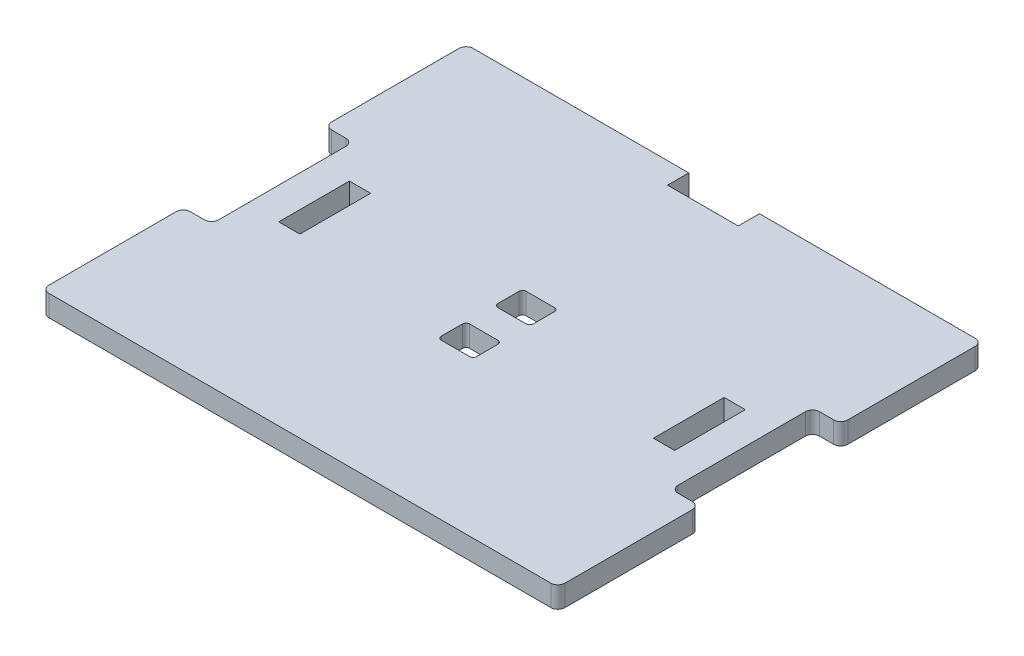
ISO-10303-21;
HEADER;
FILE_DESCRIPTION(('STEP AP214'),'2;1');
FILE_NAME('part.step','',(''),(''),'','','');
FILE_SCHEMA(('AUTOMOTIVE_DESIGN { 1 0 10303 214 1 1 1 1 }'));
ENDSEC;
DATA;
#1=APPLICATION_CONTEXT('core data for automotive mechanical design processes');
#2=APPLICATION_PROTOCOL_DEFINITION('international standard','automotive_design',2000,#1);
#3=PRODUCT_CONTEXT('',#1,'mechanical');
#4=PRODUCT('Part','Part','',(#3));
#5=PRODUCT_RELATED_PRODUCT_CATEGORY('part','',(#4));
#6=PRODUCT_DEFINITION_FORMATION('','',#4);
#7=PRODUCT_DEFINITION_CONTEXT('part definition',#1,'design');
#8=PRODUCT_DEFINITION('design','',#6,#7);
#9=PRODUCT_DEFINITION_SHAPE('','',#8);
#10=(LENGTH_UNIT() NAMED_UNIT(*) SI_UNIT(.MILLI.,.METRE.));
#11=(NAMED_UNIT(*) PLANE_ANGLE_UNIT() SI_UNIT($,.RADIAN.));
#12=(NAMED_UNIT(*) SI_UNIT($,.STERADIAN.) SOLID_ANGLE_UNIT());
#13=UNCERTAINTY_MEASURE_WITH_UNIT(LENGTH_MEASURE(1.E-05),#10,'distance_accuracy_value','');
#14=(GEOMETRIC_REPRESENTATION_CONTEXT(3) GLOBAL_UNCERTAINTY_ASSIGNED_CONTEXT((#13)) GLOBAL_UNIT_ASSIGNED_CONTEXT((#10,
#11,#12)) REPRESENTATION_CONTEXT('',''));
#15=CARTESIAN_POINT('',(0.,0.,0.));
#16=DIRECTION('',(0.,0.,1.));
#17=DIRECTION('',(1.,0.,0.));
#18=AXIS2_PLACEMENT_3D('',#15,#16,#17);
#19=CARTESIAN_POINT('',(0.,6.,-60.));
#20=DIRECTION('',(0.,0.,-1.));
#21=DIRECTION('',(-1.,0.,0.));
#22=AXIS2_PLACEMENT_3D('',#19,#20,#21);
#23=PLANE('',#22);
#24=DIRECTION('',(0.,1.,0.));
#25=VECTOR('',#24,1.);
#26=CARTESIAN_POINT('',(-10.,0.,-60.));
#27=LINE('',#26,#25);
#28=CARTESIAN_POINT('',(-10.,0.,-60.));
#29=VERTEX_POINT('',#28);
#30=CARTESIAN_POINT('',(-10.,6.,-60.));
#31=VERTEX_POINT('',#30);
#32=EDGE_CURVE('E407',#29,#31,#27,.T.);
#33=ORIENTED_EDGE('',*,*,#32,.F.);
#34=DIRECTION('',(1.,0.,0.));
#35=VECTOR('',#34,1.);
#36=CARTESIAN_POINT('',(0.,0.,-60.));
#37=LINE('',#36,#35);
#38=CARTESIAN_POINT('',(-71.,0.,-60.));
#39=VERTEX_POINT('',#38);
#40=EDGE_CURVE('E398',#39,#29,#37,.T.);
#41=ORIENTED_EDGE('',*,*,#40,.F.);
#42=DIRECTION('',(0.,-1.,0.));
#43=VECTOR('',#42,1.);
#44=CARTESIAN_POINT('',(-71.,6.,-60.));
#45=LINE('',#44,#43);
#46=CARTESIAN_POINT('',(-71.,6.,-60.));
#47=VERTEX_POINT('',#46);
#48=EDGE_CURVE('E646',#39,#47,#45,.F.);
#49=ORIENTED_EDGE('',*,*,#48,.T.);
#50=DIRECTION('',(1.,0.,0.));
#51=VECTOR('',#50,1.);
#52=CARTESIAN_POINT('',(0.,6.,-60.));
#53=LINE('',#52,#51);
#54=EDGE_CURVE('E535',#47,#31,#53,.T.);
#55=ORIENTED_EDGE('',*,*,#54,.T.);
#56=EDGE_LOOP('',(#33,#41,#49,#55));
#57=FACE_BOUND('',#56,.T.);
#58=ADVANCED_FACE('F47',(#57),#23,.T.);
#59=CARTESIAN_POINT('',(65.,6.,0.));
#60=DIRECTION('',(1.,0.,0.));
#61=DIRECTION('',(0.,0.,-1.));
#62=AXIS2_PLACEMENT_3D('',#59,#60,#61);
#63=PLANE('',#62);
#64=DIRECTION('',(0.,0.,1.));
#65=VECTOR('',#64,1.);
#66=CARTESIAN_POINT('',(65.,6.,0.));
#67=LINE('',#66,#65);
#68=CARTESIAN_POINT('',(65.,6.,-18.));
#69=VERTEX_POINT('',#68);
#70=CARTESIAN_POINT('',(65.,6.,18.));
#71=VERTEX_POINT('',#70);
#72=EDGE_CURVE('E524',#69,#71,#67,.T.);
#73=ORIENTED_EDGE('',*,*,#72,.T.);
#74=DIRECTION('',(0.,-1.,0.));
#75=VECTOR('',#74,1.);
#76=CARTESIAN_POINT('',(65.,0.,18.));
#77=LINE('',#76,#75);
#78=CARTESIAN_POINT('',(65.,0.,18.));
#79=VERTEX_POINT('',#78);
#80=EDGE_CURVE('E685',#71,#79,#77,.T.);
#81=ORIENTED_EDGE('',*,*,#80,.T.);
#82=DIRECTION('',(0.,0.,1.));
#83=VECTOR('',#82,1.);
#84=CARTESIAN_POINT('',(65.,0.,0.));
#85=LINE('',#84,#83);
#86=CARTESIAN_POINT('',(65.,0.,-18.));
#87=VERTEX_POINT('',#86);
#88=EDGE_CURVE('E523',#87,#79,#85,.T.);
#89=ORIENTED_EDGE('',*,*,#88,.F.);
#90=DIRECTION('',(0.,-1.,0.));
#91=VECTOR('',#90,1.);
#92=CARTESIAN_POINT('',(65.,6.,-18.));
#93=LINE('',#92,#91);
#94=EDGE_CURVE('E683',#87,#69,#93,.F.);
#95=ORIENTED_EDGE('',*,*,#94,.T.);
#96=EDGE_LOOP('',(#73,#81,#89,#95));
#97=FACE_BOUND('',#96,.T.);
#98=ADVANCED_FACE('F819',(#97),#63,.T.);
#99=CARTESIAN_POINT('',(0.,6.,-20.));
#100=DIRECTION('',(0.,0.,-1.));
#101=DIRECTION('',(-1.,0.,0.));
#102=AXIS2_PLACEMENT_3D('',#99,#100,#101);
#103=PLANE('',#102);
#104=DIRECTION('',(1.,0.,0.));
#105=VECTOR('',#104,1.);
#106=CARTESIAN_POINT('',(0.,0.,-20.));
#107=LINE('',#106,#105);
#108=CARTESIAN_POINT('',(67.,0.,-20.));
#109=VERTEX_POINT('',#108);
#110=CARTESIAN_POINT('',(71.,0.,-20.));
#111=VERTEX_POINT('',#110);
#112=EDGE_CURVE('E565',#109,#111,#107,.T.);
#113=ORIENTED_EDGE('',*,*,#112,.T.);
#114=DIRECTION('',(0.,-1.,0.));
#115=VECTOR('',#114,1.);
#116=CARTESIAN_POINT('',(71.,6.,-20.));
#117=LINE('',#116,#115);
#118=CARTESIAN_POINT('',(71.,6.,-20.));
#119=VERTEX_POINT('',#118);
#120=EDGE_CURVE('E676',#111,#119,#117,.F.);
#121=ORIENTED_EDGE('',*,*,#120,.T.);
#122=DIRECTION('',(1.,0.,0.));
#123=VECTOR('',#122,1.);
#124=CARTESIAN_POINT('',(0.,6.,-20.));
#125=LINE('',#124,#123);
#126=CARTESIAN_POINT('',(67.,6.,-20.));
#127=VERTEX_POINT('',#126);
#128=EDGE_CURVE('E527',#127,#119,#125,.T.);
#129=ORIENTED_EDGE('',*,*,#128,.F.);
#130=DIRECTION('',(0.,-1.,0.));
#131=VECTOR('',#130,1.);
#132=CARTESIAN_POINT('',(67.,6.,-20.));
#133=LINE('',#132,#131);
#134=EDGE_CURVE('E673',#127,#109,#133,.T.);
#135=ORIENTED_EDGE('',*,*,#134,.T.);
#136=EDGE_LOOP('',(#113,#121,#129,#135));
#137=FACE_BOUND('',#136,.T.);
#138=ADVANCED_FACE('F828',(#137),#103,.F.);
#139=CARTESIAN_POINT('',(73.,6.,0.));
#140=DIRECTION('',(-1.,0.,0.));
#141=DIRECTION('',(0.,0.,1.));
#142=AXIS2_PLACEMENT_3D('',#139,#140,#141);
#143=PLANE('',#142);
#144=DIRECTION('',(0.,0.,-1.));
#145=VECTOR('',#144,1.);
#146=CARTESIAN_POINT('',(73.,0.,0.));
#147=LINE('',#146,#145);
#148=CARTESIAN_POINT('',(73.,0.,-22.));
#149=VERTEX_POINT('',#148);
#150=CARTESIAN_POINT('',(73.,0.,-58.));
#151=VERTEX_POINT('',#150);
#152=EDGE_CURVE('E568',#149,#151,#147,.T.);
#153=ORIENTED_EDGE('',*,*,#152,.T.);
#154=DIRECTION('',(0.,-1.,0.));
#155=VECTOR('',#154,1.);
#156=CARTESIAN_POINT('',(73.,6.,-58.));
#157=LINE('',#156,#155);
#158=CARTESIAN_POINT('',(73.,6.,-58.));
#159=VERTEX_POINT('',#158);
#160=EDGE_CURVE('E671',#151,#159,#157,.F.);
#161=ORIENTED_EDGE('',*,*,#160,.T.);
#162=DIRECTION('',(0.,0.,-1.));
#163=VECTOR('',#162,1.);
#164=CARTESIAN_POINT('',(73.,6.,0.));
#165=LINE('',#164,#163);
#166=CARTESIAN_POINT('',(73.,6.,-22.));
#167=VERTEX_POINT('',#166);
#168=EDGE_CURVE('E531',#167,#159,#165,.T.);
#169=ORIENTED_EDGE('',*,*,#168,.F.);
#170=DIRECTION('',(0.,-1.,0.));
#171=VECTOR('',#170,1.);
#172=CARTESIAN_POINT('',(73.,6.,-22.));
#173=LINE('',#172,#171);
#174=EDGE_CURVE('E668',#167,#149,#173,.T.);
#175=ORIENTED_EDGE('',*,*,#174,.T.);
#176=EDGE_LOOP('',(#153,#161,#169,#175));
#177=FACE_BOUND('',#176,.T.);
#178=ADVANCED_FACE('F834',(#177),#143,.F.);
#179=DIRECTION('',(0.,1.,0.));
#180=VECTOR('',#179,1.);
#181=CARTESIAN_POINT('',(10.,0.,-60.));
#182=LINE('',#181,#180);
#183=CARTESIAN_POINT('',(10.,0.,-60.));
#184=VERTEX_POINT('',#183);
#185=CARTESIAN_POINT('',(10.,6.,-60.));
#186=VERTEX_POINT('',#185);
#187=EDGE_CURVE('E410',#184,#186,#182,.T.);
#188=ORIENTED_EDGE('',*,*,#187,.T.);
#189=CARTESIAN_POINT('',(71.,6.,-60.));
#190=VERTEX_POINT('',#189);
#191=EDGE_CURVE('E534',#186,#190,#53,.T.);
#192=ORIENTED_EDGE('',*,*,#191,.T.);
#193=DIRECTION('',(0.,-1.,0.));
#194=VECTOR('',#193,1.);
#195=CARTESIAN_POINT('',(71.,0.,-60.));
#196=LINE('',#195,#194);
#197=CARTESIAN_POINT('',(71.,0.,-60.));
#198=VERTEX_POINT('',#197);
#199=EDGE_CURVE('E643',#190,#198,#196,.T.);
#200=ORIENTED_EDGE('',*,*,#199,.T.);
#201=EDGE_CURVE('E571',#184,#198,#37,.T.);
#202=ORIENTED_EDGE('',*,*,#201,.F.);
#203=EDGE_LOOP('',(#188,#192,#200,#202));
#204=FACE_BOUND('',#203,.T.);
#205=ADVANCED_FACE('F822',(#204),#23,.T.);
#206=CARTESIAN_POINT('',(-73.,6.,0.));
#207=DIRECTION('',(-1.,0.,0.));
#208=DIRECTION('',(0.,0.,1.));
#209=AXIS2_PLACEMENT_3D('',#206,#207,#208);
#210=PLANE('',#209);
#211=DIRECTION('',(0.,0.,-1.));
#212=VECTOR('',#211,1.);
#213=CARTESIAN_POINT('',(-73.,0.,0.));
#214=LINE('',#213,#212);
#215=CARTESIAN_POINT('',(-73.,0.,-22.));
#216=VERTEX_POINT('',#215);
#217=CARTESIAN_POINT('',(-73.,0.,-58.));
#218=VERTEX_POINT('',#217);
#219=EDGE_CURVE('E573',#216,#218,#214,.T.);
#220=ORIENTED_EDGE('',*,*,#219,.F.);
#221=DIRECTION('',(0.,-1.,0.));
#222=VECTOR('',#221,1.);
#223=CARTESIAN_POINT('',(-73.,6.,-22.));
#224=LINE('',#223,#222);
#225=CARTESIAN_POINT('',(-73.,6.,-22.));
#226=VERTEX_POINT('',#225);
#227=EDGE_CURVE('E619',#216,#226,#224,.F.);
#228=ORIENTED_EDGE('',*,*,#227,.T.);
#229=DIRECTION('',(0.,0.,-1.));
#230=VECTOR('',#229,1.);
#231=CARTESIAN_POINT('',(-73.,6.,0.));
#232=LINE('',#231,#230);
#233=CARTESIAN_POINT('',(-73.,6.,-58.));
#234=VERTEX_POINT('',#233);
#235=EDGE_CURVE('E538',#226,#234,#232,.T.);
#236=ORIENTED_EDGE('',*,*,#235,.T.);
#237=DIRECTION('',(0.,-1.,0.));
#238=VECTOR('',#237,1.);
#239=CARTESIAN_POINT('',(-73.,6.,-58.));
#240=LINE('',#239,#238);
#241=EDGE_CURVE('E616',#234,#218,#240,.T.);
#242=ORIENTED_EDGE('',*,*,#241,.T.);
#243=EDGE_LOOP('',(#220,#228,#236,#242));
#244=FACE_BOUND('',#243,.T.);
#245=ADVANCED_FACE('F833',(#244),#210,.T.);
#246=CARTESIAN_POINT('',(0.,6.,-20.));
#247=DIRECTION('',(0.,0.,1.));
#248=DIRECTION('',(1.,0.,0.));
#249=AXIS2_PLACEMENT_3D('',#246,#247,#248);
#250=PLANE('',#249);
#251=DIRECTION('',(-1.,0.,0.));
#252=VECTOR('',#251,1.);
#253=CARTESIAN_POINT('',(0.,6.,-20.));
#254=LINE('',#253,#252);
#255=CARTESIAN_POINT('',(-67.,6.,-20.));
#256=VERTEX_POINT('',#255);
#257=CARTESIAN_POINT('',(-71.,6.,-20.));
#258=VERTEX_POINT('',#257);
#259=EDGE_CURVE('E541',#256,#258,#254,.T.);
#260=ORIENTED_EDGE('',*,*,#259,.T.);
#261=DIRECTION('',(0.,-1.,0.));
#262=VECTOR('',#261,1.);
#263=CARTESIAN_POINT('',(-71.,6.,-20.));
#264=LINE('',#263,#262);
#265=CARTESIAN_POINT('',(-71.,0.,-20.));
#266=VERTEX_POINT('',#265);
#267=EDGE_CURVE('E597',#258,#266,#264,.T.);
#268=ORIENTED_EDGE('',*,*,#267,.T.);
#269=DIRECTION('',(-1.,0.,0.));
#270=VECTOR('',#269,1.);
#271=CARTESIAN_POINT('',(0.,0.,-20.));
#272=LINE('',#271,#270);
#273=CARTESIAN_POINT('',(-67.,0.,-20.));
#274=VERTEX_POINT('',#273);
#275=EDGE_CURVE('E576',#274,#266,#272,.T.);
#276=ORIENTED_EDGE('',*,*,#275,.F.);
#277=DIRECTION('',(0.,-1.,0.));
#278=VECTOR('',#277,1.);
#279=CARTESIAN_POINT('',(-67.,6.,-20.));
#280=LINE('',#279,#278);
#281=EDGE_CURVE('E562',#274,#256,#280,.F.);
#282=ORIENTED_EDGE('',*,*,#281,.T.);
#283=EDGE_LOOP('',(#260,#268,#276,#282));
#284=FACE_BOUND('',#283,.T.);
#285=ADVANCED_FACE('F840',(#284),#250,.T.);
#286=CARTESIAN_POINT('',(-65.,6.,0.));
#287=DIRECTION('',(1.,0.,0.));
#288=DIRECTION('',(0.,0.,-1.));
#289=AXIS2_PLACEMENT_3D('',#286,#287,#288);
#290=PLANE('',#289);
#291=DIRECTION('',(0.,0.,1.));
#292=VECTOR('',#291,1.);
#293=CARTESIAN_POINT('',(-65.,6.,0.));
#294=LINE('',#293,#292);
#295=CARTESIAN_POINT('',(-65.,6.,-18.));
#296=VERTEX_POINT('',#295);
#297=CARTESIAN_POINT('',(-65.,6.,18.));
#298=VERTEX_POINT('',#297);
#299=EDGE_CURVE('E544',#296,#298,#294,.T.);
#300=ORIENTED_EDGE('',*,*,#299,.F.);
#301=DIRECTION('',(0.,-1.,0.));
#302=VECTOR('',#301,1.);
#303=CARTESIAN_POINT('',(-65.,6.,-18.));
#304=LINE('',#303,#302);
#305=CARTESIAN_POINT('',(-65.,0.,-18.));
#306=VERTEX_POINT('',#305);
#307=EDGE_CURVE('E640',#296,#306,#304,.T.);
#308=ORIENTED_EDGE('',*,*,#307,.T.);
#309=DIRECTION('',(0.,0.,1.));
#310=VECTOR('',#309,1.);
#311=CARTESIAN_POINT('',(-65.,0.,0.));
#312=LINE('',#311,#310);
#313=CARTESIAN_POINT('',(-65.,0.,18.));
#314=VERTEX_POINT('',#313);
#315=EDGE_CURVE('E579',#306,#314,#312,.T.);
#316=ORIENTED_EDGE('',*,*,#315,.T.);
#317=DIRECTION('',(0.,-1.,0.));
#318=VECTOR('',#317,1.);
#319=CARTESIAN_POINT('',(-65.,6.,18.));
#320=LINE('',#319,#318);
#321=EDGE_CURVE('E638',#314,#298,#320,.F.);
#322=ORIENTED_EDGE('',*,*,#321,.T.);
#323=EDGE_LOOP('',(#300,#308,#316,#322));
#324=FACE_BOUND('',#323,.T.);
#325=ADVANCED_FACE('F924',(#324),#290,.F.);
#326=CARTESIAN_POINT('',(0.,6.,19.9999999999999));
#327=DIRECTION('',(0.,0.,1.));
#328=DIRECTION('',(1.,0.,0.));
#329=AXIS2_PLACEMENT_3D('',#326,#327,#328);
#330=PLANE('',#329);
#331=DIRECTION('',(-1.,0.,0.));
#332=VECTOR('',#331,1.);
#333=CARTESIAN_POINT('',(0.,0.,19.9999999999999));
#334=LINE('',#333,#332);
#335=CARTESIAN_POINT('',(-67.,0.,20.));
#336=VERTEX_POINT('',#335);
#337=CARTESIAN_POINT('',(-71.,0.,20.));
#338=VERTEX_POINT('',#337);
#339=EDGE_CURVE('E582',#336,#338,#334,.T.);
#340=ORIENTED_EDGE('',*,*,#339,.T.);
#341=DIRECTION('',(0.,-1.,0.));
#342=VECTOR('',#341,1.);
#343=CARTESIAN_POINT('',(-71.,6.,20.));
#344=LINE('',#343,#342);
#345=CARTESIAN_POINT('',(-71.,6.,20.));
#346=VERTEX_POINT('',#345);
#347=EDGE_CURVE('E656',#338,#346,#344,.F.);
#348=ORIENTED_EDGE('',*,*,#347,.T.);
#349=DIRECTION('',(-1.,0.,0.));
#350=VECTOR('',#349,1.);
#351=CARTESIAN_POINT('',(0.,6.,19.9999999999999));
#352=LINE('',#351,#350);
#353=CARTESIAN_POINT('',(-67.,6.,20.));
#354=VERTEX_POINT('',#353);
#355=EDGE_CURVE('E547',#354,#346,#352,.T.);
#356=ORIENTED_EDGE('',*,*,#355,.F.);
#357=DIRECTION('',(0.,-1.,0.));
#358=VECTOR('',#357,1.);
#359=CARTESIAN_POINT('',(-67.,0.,20.));
#360=LINE('',#359,#358);
#361=EDGE_CURVE('E653',#354,#336,#360,.T.);
#362=ORIENTED_EDGE('',*,*,#361,.T.);
#363=EDGE_LOOP('',(#340,#348,#356,#362));
#364=FACE_BOUND('',#363,.T.);
#365=ADVANCED_FACE('F914',(#364),#330,.F.);
#366=CARTESIAN_POINT('',(-73.,6.,0.));
#367=DIRECTION('',(1.,0.,0.));
#368=DIRECTION('',(0.,0.,-1.));
#369=AXIS2_PLACEMENT_3D('',#366,#367,#368);
#370=PLANE('',#369);
#371=DIRECTION('',(0.,0.,1.));
#372=VECTOR('',#371,1.);
#373=CARTESIAN_POINT('',(-73.,6.,0.));
#374=LINE('',#373,#372);
#375=CARTESIAN_POINT('',(-73.,6.,22.));
#376=VERTEX_POINT('',#375);
#377=CARTESIAN_POINT('',(-73.,6.,58.));
#378=VERTEX_POINT('',#377);
#379=EDGE_CURVE('E550',#376,#378,#374,.T.);
#380=ORIENTED_EDGE('',*,*,#379,.F.);
#381=DIRECTION('',(0.,-1.,0.));
#382=VECTOR('',#381,1.);
#383=CARTESIAN_POINT('',(-73.,6.,22.));
#384=LINE('',#383,#382);
#385=CARTESIAN_POINT('',(-73.,0.,22.));
#386=VERTEX_POINT('',#385);
#387=EDGE_CURVE('E650',#376,#386,#384,.T.);
#388=ORIENTED_EDGE('',*,*,#387,.T.);
#389=DIRECTION('',(0.,0.,1.));
#390=VECTOR('',#389,1.);
#391=CARTESIAN_POINT('',(-73.,0.,0.));
#392=LINE('',#391,#390);
#393=CARTESIAN_POINT('',(-73.,0.,58.));
#394=VERTEX_POINT('',#393);
#395=EDGE_CURVE('E585',#386,#394,#392,.T.);
#396=ORIENTED_EDGE('',*,*,#395,.T.);
#397=DIRECTION('',(0.,-1.,0.));
#398=VECTOR('',#397,1.);
#399=CARTESIAN_POINT('',(-73.,6.,58.));
#400=LINE('',#399,#398);
#401=EDGE_CURVE('E648',#394,#378,#400,.F.);
#402=ORIENTED_EDGE('',*,*,#401,.T.);
#403=EDGE_LOOP('',(#380,#388,#396,#402));
#404=FACE_BOUND('',#403,.T.);
#405=ADVANCED_FACE('F906',(#404),#370,.F.);
#406=CARTESIAN_POINT('',(0.,6.,60.));
#407=DIRECTION('',(0.,0.,-1.));
#408=DIRECTION('',(-1.,0.,0.));
#409=AXIS2_PLACEMENT_3D('',#406,#407,#408);
#410=PLANE('',#409);
#411=DIRECTION('',(1.,0.,0.));
#412=VECTOR('',#411,1.);
#413=CARTESIAN_POINT('',(0.,6.,60.));
#414=LINE('',#413,#412);
#415=CARTESIAN_POINT('',(-71.,6.,60.));
#416=VERTEX_POINT('',#415);
#417=CARTESIAN_POINT('',(71.,6.,60.));
#418=VERTEX_POINT('',#417);
#419=EDGE_CURVE('E553',#416,#418,#414,.T.);
#420=ORIENTED_EDGE('',*,*,#419,.F.);
#421=DIRECTION('',(0.,-1.,0.));
#422=VECTOR('',#421,1.);
#423=CARTESIAN_POINT('',(-71.,6.,60.));
#424=LINE('',#423,#422);
#425=CARTESIAN_POINT('',(-71.,0.,60.));
#426=VERTEX_POINT('',#425);
#427=EDGE_CURVE('E660',#416,#426,#424,.T.);
#428=ORIENTED_EDGE('',*,*,#427,.T.);
#429=DIRECTION('',(1.,0.,0.));
#430=VECTOR('',#429,1.);
#431=CARTESIAN_POINT('',(0.,0.,60.));
#432=LINE('',#431,#430);
#433=CARTESIAN_POINT('',(71.,0.,60.));
#434=VERTEX_POINT('',#433);
#435=EDGE_CURVE('E588',#426,#434,#432,.T.);
#436=ORIENTED_EDGE('',*,*,#435,.T.);
#437=DIRECTION('',(0.,-1.,0.));
#438=VECTOR('',#437,1.);
#439=CARTESIAN_POINT('',(71.,6.,60.));
#440=LINE('',#439,#438);
#441=EDGE_CURVE('E658',#434,#418,#440,.F.);
#442=ORIENTED_EDGE('',*,*,#441,.T.);
#443=EDGE_LOOP('',(#420,#428,#436,#442));
#444=FACE_BOUND('',#443,.T.);
#445=ADVANCED_FACE('F897',(#444),#410,.F.);
#446=CARTESIAN_POINT('',(73.,6.,0.));
#447=DIRECTION('',(1.,0.,0.));
#448=DIRECTION('',(0.,0.,-1.));
#449=AXIS2_PLACEMENT_3D('',#446,#447,#448);
#450=PLANE('',#449);
#451=DIRECTION('',(0.,0.,1.));
#452=VECTOR('',#451,1.);
#453=CARTESIAN_POINT('',(73.,6.,0.));
#454=LINE('',#453,#452);
#455=CARTESIAN_POINT('',(73.,6.,22.));
#456=VERTEX_POINT('',#455);
#457=CARTESIAN_POINT('',(73.,6.,58.));
#458=VERTEX_POINT('',#457);
#459=EDGE_CURVE('E556',#456,#458,#454,.T.);
#460=ORIENTED_EDGE('',*,*,#459,.T.);
#461=DIRECTION('',(0.,-1.,0.));
#462=VECTOR('',#461,1.);
#463=CARTESIAN_POINT('',(73.,0.,58.));
#464=LINE('',#463,#462);
#465=CARTESIAN_POINT('',(73.,0.,58.));
#466=VERTEX_POINT('',#465);
#467=EDGE_CURVE('E665',#458,#466,#464,.T.);
#468=ORIENTED_EDGE('',*,*,#467,.T.);
#469=DIRECTION('',(0.,0.,1.));
#470=VECTOR('',#469,1.);
#471=CARTESIAN_POINT('',(73.,0.,0.));
#472=LINE('',#471,#470);
#473=CARTESIAN_POINT('',(73.,0.,22.));
#474=VERTEX_POINT('',#473);
#475=EDGE_CURVE('E591',#474,#466,#472,.T.);
#476=ORIENTED_EDGE('',*,*,#475,.F.);
#477=DIRECTION('',(0.,-1.,0.));
#478=VECTOR('',#477,1.);
#479=CARTESIAN_POINT('',(73.,6.,22.));
#480=LINE('',#479,#478);
#481=EDGE_CURVE('E663',#474,#456,#480,.F.);
#482=ORIENTED_EDGE('',*,*,#481,.T.);
#483=EDGE_LOOP('',(#460,#468,#476,#482));
#484=FACE_BOUND('',#483,.T.);
#485=ADVANCED_FACE('F887',(#484),#450,.T.);
#486=CARTESIAN_POINT('',(0.,6.,19.9999999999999));
#487=DIRECTION('',(0.,0.,-1.));
#488=DIRECTION('',(-1.,0.,0.));
#489=AXIS2_PLACEMENT_3D('',#486,#487,#488);
#490=PLANE('',#489);
#491=DIRECTION('',(1.,0.,0.));
#492=VECTOR('',#491,1.);
#493=CARTESIAN_POINT('',(0.,6.,19.9999999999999));
#494=LINE('',#493,#492);
#495=CARTESIAN_POINT('',(67.,6.,20.));
#496=VERTEX_POINT('',#495);
#497=CARTESIAN_POINT('',(71.,6.,20.));
#498=VERTEX_POINT('',#497);
#499=EDGE_CURVE('E559',#496,#498,#494,.T.);
#500=ORIENTED_EDGE('',*,*,#499,.T.);
#501=DIRECTION('',(0.,-1.,0.));
#502=VECTOR('',#501,1.);
#503=CARTESIAN_POINT('',(71.,6.,20.));
#504=LINE('',#503,#502);
#505=CARTESIAN_POINT('',(71.,0.,20.));
#506=VERTEX_POINT('',#505);
#507=EDGE_CURVE('E680',#498,#506,#504,.T.);
#508=ORIENTED_EDGE('',*,*,#507,.T.);
#509=DIRECTION('',(1.,0.,0.));
#510=VECTOR('',#509,1.);
#511=CARTESIAN_POINT('',(0.,0.,19.9999999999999));
#512=LINE('',#511,#510);
#513=CARTESIAN_POINT('',(67.,0.,20.));
#514=VERTEX_POINT('',#513);
#515=EDGE_CURVE('E528',#514,#506,#512,.T.);
#516=ORIENTED_EDGE('',*,*,#515,.F.);
#517=DIRECTION('',(0.,-1.,0.));
#518=VECTOR('',#517,1.);
#519=CARTESIAN_POINT('',(67.,6.,20.));
#520=LINE('',#519,#518);
#521=EDGE_CURVE('E678',#514,#496,#520,.F.);
#522=ORIENTED_EDGE('',*,*,#521,.T.);
#523=EDGE_LOOP('',(#500,#508,#516,#522));
#524=FACE_BOUND('',#523,.T.);
#525=ADVANCED_FACE('F878',(#524),#490,.T.);
#526=CARTESIAN_POINT('',(0.,6.,0.));
#527=DIRECTION('',(0.,1.,0.));
#528=DIRECTION('',(0.,0.,1.));
#529=AXIS2_PLACEMENT_3D('',#526,#527,#528);
#530=PLANE('',#529);
#531=DIRECTION('',(0.,0.,1.));
#532=VECTOR('',#531,1.);
#533=CARTESIAN_POINT('',(-10.,6.,-60.));
#534=LINE('',#533,#532);
#535=CARTESIAN_POINT('',(-10.,6.,-54.));
#536=VERTEX_POINT('',#535);
#537=EDGE_CURVE('E383',#31,#536,#534,.T.);
#538=ORIENTED_EDGE('',*,*,#537,.F.);
#539=ORIENTED_EDGE('',*,*,#54,.F.);
#540=CARTESIAN_POINT('',(-71.,6.,-58.));
#541=DIRECTION('',(0.,1.,0.));
#542=DIRECTION('',(0.,0.,1.));
#543=AXIS2_PLACEMENT_3D('',#540,#541,#542);
#544=CIRCLE('',#543,2.);
#545=EDGE_CURVE('E634',#47,#234,#544,.T.);
#546=ORIENTED_EDGE('',*,*,#545,.T.);
#547=ORIENTED_EDGE('',*,*,#235,.F.);
#548=CARTESIAN_POINT('',(-71.,6.,-22.));
#549=DIRECTION('',(0.,1.,0.));
#550=DIRECTION('',(0.,0.,1.));
#551=AXIS2_PLACEMENT_3D('',#548,#549,#550);
#552=CIRCLE('',#551,2.);
#553=EDGE_CURVE('E636',#226,#258,#552,.T.);
#554=ORIENTED_EDGE('',*,*,#553,.T.);
#555=ORIENTED_EDGE('',*,*,#259,.F.);
#556=CARTESIAN_POINT('',(-67.,6.,-18.));
#557=DIRECTION('',(0.,1.,0.));
#558=DIRECTION('',(0.,0.,1.));
#559=AXIS2_PLACEMENT_3D('',#556,#557,#558);
#560=CIRCLE('',#559,2.);
#561=EDGE_CURVE('E690',#256,#296,#560,.F.);
#562=ORIENTED_EDGE('',*,*,#561,.T.);
#563=ORIENTED_EDGE('',*,*,#299,.T.);
#564=CARTESIAN_POINT('',(-67.,6.,18.));
#565=DIRECTION('',(0.,1.,0.));
#566=DIRECTION('',(0.,0.,1.));
#567=AXIS2_PLACEMENT_3D('',#564,#565,#566);
#568=CIRCLE('',#567,2.);
#569=EDGE_CURVE('E694',#298,#354,#568,.F.);
#570=ORIENTED_EDGE('',*,*,#569,.T.);
#571=ORIENTED_EDGE('',*,*,#355,.T.);
#572=CARTESIAN_POINT('',(-71.,6.,22.));
#573=DIRECTION('',(0.,1.,0.));
#574=DIRECTION('',(0.,0.,1.));
#575=AXIS2_PLACEMENT_3D('',#572,#573,#574);
#576=CIRCLE('',#575,2.);
#577=EDGE_CURVE('E632',#346,#376,#576,.T.);
#578=ORIENTED_EDGE('',*,*,#577,.T.);
#579=ORIENTED_EDGE('',*,*,#379,.T.);
#580=CARTESIAN_POINT('',(-71.,6.,58.));
#581=DIRECTION('',(0.,1.,0.));
#582=DIRECTION('',(0.,0.,1.));
#583=AXIS2_PLACEMENT_3D('',#580,#581,#582);
#584=CIRCLE('',#583,2.);
#585=EDGE_CURVE('E630',#378,#416,#584,.T.);
#586=ORIENTED_EDGE('',*,*,#585,.T.);
#587=ORIENTED_EDGE('',*,*,#419,.T.);
#588=CARTESIAN_POINT('',(71.,6.,58.));
#589=DIRECTION('',(0.,1.,0.));
#590=DIRECTION('',(0.,0.,1.));
#591=AXIS2_PLACEMENT_3D('',#588,#589,#590);
#592=CIRCLE('',#591,2.);
#593=EDGE_CURVE('E628',#418,#458,#592,.T.);
#594=ORIENTED_EDGE('',*,*,#593,.T.);
#595=ORIENTED_EDGE('',*,*,#459,.F.);
#596=CARTESIAN_POINT('',(71.,6.,22.));
#597=DIRECTION('',(0.,1.,0.));
#598=DIRECTION('',(0.,0.,1.));
#599=AXIS2_PLACEMENT_3D('',#596,#597,#598);
#600=CIRCLE('',#599,2.);
#601=EDGE_CURVE('E621',#456,#498,#600,.T.);
#602=ORIENTED_EDGE('',*,*,#601,.T.);
#603=ORIENTED_EDGE('',*,*,#499,.F.);
#604=CARTESIAN_POINT('',(67.,6.,18.));
#605=DIRECTION('',(0.,1.,0.));
#606=DIRECTION('',(0.,0.,1.));
#607=AXIS2_PLACEMENT_3D('',#604,#605,#606);
#608=CIRCLE('',#607,2.);
#609=EDGE_CURVE('E698',#496,#71,#608,.F.);
#610=ORIENTED_EDGE('',*,*,#609,.T.);
#611=ORIENTED_EDGE('',*,*,#72,.F.);
#612=CARTESIAN_POINT('',(67.,6.,-18.));
#613=DIRECTION('',(0.,1.,0.));
#614=DIRECTION('',(0.,0.,1.));
#615=AXIS2_PLACEMENT_3D('',#612,#613,#614);
#616=CIRCLE('',#615,2.);
#617=EDGE_CURVE('E702',#69,#127,#616,.F.);
#618=ORIENTED_EDGE('',*,*,#617,.T.);
#619=ORIENTED_EDGE('',*,*,#128,.T.);
#620=CARTESIAN_POINT('',(71.,6.,-22.));
#621=DIRECTION('',(0.,1.,0.));
#622=DIRECTION('',(0.,0.,1.));
#623=AXIS2_PLACEMENT_3D('',#620,#621,#622);
#624=CIRCLE('',#623,2.);
#625=EDGE_CURVE('E623',#119,#167,#624,.T.);
#626=ORIENTED_EDGE('',*,*,#625,.T.);
#627=ORIENTED_EDGE('',*,*,#168,.T.);
#628=CARTESIAN_POINT('',(71.,6.,-58.));
#629=DIRECTION('',(0.,1.,0.));
#630=DIRECTION('',(0.,0.,1.));
#631=AXIS2_PLACEMENT_3D('',#628,#629,#630);
#632=CIRCLE('',#631,2.);
#633=EDGE_CURVE('E625',#159,#190,#632,.T.);
#634=ORIENTED_EDGE('',*,*,#633,.T.);
#635=ORIENTED_EDGE('',*,*,#191,.F.);
#636=DIRECTION('',(0.,0.,-1.));
#637=VECTOR('',#636,1.);
#638=CARTESIAN_POINT('',(10.,6.,-60.));
#639=LINE('',#638,#637);
#640=CARTESIAN_POINT('',(10.,6.,-54.));
#641=VERTEX_POINT('',#640);
#642=EDGE_CURVE('E399',#641,#186,#639,.T.);
#643=ORIENTED_EDGE('',*,*,#642,.F.);
#644=DIRECTION('',(1.,0.,0.));
#645=VECTOR('',#644,1.);
#646=CARTESIAN_POINT('',(-10.,6.,-54.));
#647=LINE('',#646,#645);
#648=EDGE_CURVE('E401',#536,#641,#647,.T.);
#649=ORIENTED_EDGE('',*,*,#648,.F.);
#650=EDGE_LOOP('',(#538,#539,#546,#547,#554,#555,#562,#563,#570,#571,#578,#579,#586,#587,#594,
#595,#602,#603,#610,#611,#618,#619,#626,#627,#634,#635,#643,#649));
#651=FACE_BOUND('',#650,.T.);
#652=DIRECTION('',(0.,0.,-1.));
#653=VECTOR('',#652,1.);
#654=CARTESIAN_POINT('',(5.,6.,-8.));
#655=LINE('',#654,#653);
#656=CARTESIAN_POINT('',(5.,6.,-1.));
#657=VERTEX_POINT('',#656);
#658=CARTESIAN_POINT('',(5.,6.,-7.));
#659=VERTEX_POINT('',#658);
#660=EDGE_CURVE('E427',#657,#659,#655,.T.);
#661=ORIENTED_EDGE('',*,*,#660,.F.);
#662=CARTESIAN_POINT('',(4.,6.,-1.));
#663=DIRECTION('',(0.,1.,0.));
#664=DIRECTION('',(0.,0.,1.));
#665=AXIS2_PLACEMENT_3D('',#662,#663,#664);
#666=CIRCLE('',#665,1.);
#667=CARTESIAN_POINT('',(4.,6.,0.));
#668=VERTEX_POINT('',#667);
#669=EDGE_CURVE('E755',#657,#668,#666,.F.);
#670=ORIENTED_EDGE('',*,*,#669,.T.);
#671=DIRECTION('',(1.,0.,0.));
#672=VECTOR('',#671,1.);
#673=CARTESIAN_POINT('',(-5.,6.,0.));
#674=LINE('',#673,#672);
#675=CARTESIAN_POINT('',(-4.,6.,0.));
#676=VERTEX_POINT('',#675);
#677=EDGE_CURVE('E418',#676,#668,#674,.T.);
#678=ORIENTED_EDGE('',*,*,#677,.F.);
#679=CARTESIAN_POINT('',(-4.,6.,-1.));
#680=DIRECTION('',(0.,1.,0.));
#681=DIRECTION('',(0.,0.,1.));
#682=AXIS2_PLACEMENT_3D('',#679,#680,#681);
#683=CIRCLE('',#682,1.);
#684=CARTESIAN_POINT('',(-5.,6.,-1.));
#685=VERTEX_POINT('',#684);
#686=EDGE_CURVE('E763',#676,#685,#683,.F.);
#687=ORIENTED_EDGE('',*,*,#686,.T.);
#688=DIRECTION('',(0.,0.,1.));
#689=VECTOR('',#688,1.);
#690=CARTESIAN_POINT('',(-5.,6.,-8.));
#691=LINE('',#690,#689);
#692=CARTESIAN_POINT('',(-5.,6.,-7.));
#693=VERTEX_POINT('',#692);
#694=EDGE_CURVE('E434',#693,#685,#691,.T.);
#695=ORIENTED_EDGE('',*,*,#694,.F.);
#696=CARTESIAN_POINT('',(-4.,6.,-7.));
#697=DIRECTION('',(0.,1.,0.));
#698=DIRECTION('',(0.,0.,1.));
#699=AXIS2_PLACEMENT_3D('',#696,#697,#698);
#700=CIRCLE('',#699,1.);
#701=CARTESIAN_POINT('',(-4.,6.,-8.));
#702=VERTEX_POINT('',#701);
#703=EDGE_CURVE('E55',#693,#702,#700,.F.);
#704=ORIENTED_EDGE('',*,*,#703,.T.);
#705=DIRECTION('',(-1.,0.,0.));
#706=VECTOR('',#705,1.);
#707=CARTESIAN_POINT('',(-5.,6.,-8.));
#708=LINE('',#707,#706);
#709=CARTESIAN_POINT('',(4.,6.,-8.));
#710=VERTEX_POINT('',#709);
#711=EDGE_CURVE('E430',#710,#702,#708,.T.);
#712=ORIENTED_EDGE('',*,*,#711,.F.);
#713=CARTESIAN_POINT('',(4.,6.,-7.));
#714=DIRECTION('',(0.,1.,0.));
#715=DIRECTION('',(0.,0.,1.));
#716=AXIS2_PLACEMENT_3D('',#713,#714,#715);
#717=CIRCLE('',#716,1.);
#718=EDGE_CURVE('E747',#710,#659,#717,.F.);
#719=ORIENTED_EDGE('',*,*,#718,.T.);
#720=EDGE_LOOP('',(#661,#670,#678,#687,#695,#704,#712,#719));
#721=FACE_BOUND('',#720,.T.);
#722=DIRECTION('',(0.,0.,1.));
#723=VECTOR('',#722,1.);
#724=CARTESIAN_POINT('',(-5.,6.,8.));
#725=LINE('',#724,#723);
#726=CARTESIAN_POINT('',(-5.,6.,9.));
#727=VERTEX_POINT('',#726);
#728=CARTESIAN_POINT('',(-5.,6.,15.));
#729=VERTEX_POINT('',#728);
#730=EDGE_CURVE('E431',#727,#729,#725,.T.);
#731=ORIENTED_EDGE('',*,*,#730,.F.);
#732=CARTESIAN_POINT('',(-4.,6.,9.));
#733=DIRECTION('',(0.,1.,0.));
#734=DIRECTION('',(0.,0.,1.));
#735=AXIS2_PLACEMENT_3D('',#732,#733,#734);
#736=CIRCLE('',#735,1.);
#737=CARTESIAN_POINT('',(-4.,6.,8.));
#738=VERTEX_POINT('',#737);
#739=EDGE_CURVE('E767',#727,#738,#736,.F.);
#740=ORIENTED_EDGE('',*,*,#739,.T.);
#741=DIRECTION('',(-1.,0.,0.));
#742=VECTOR('',#741,1.);
#743=CARTESIAN_POINT('',(-5.,6.,8.));
#744=LINE('',#743,#742);
#745=CARTESIAN_POINT('',(4.,6.,8.));
#746=VERTEX_POINT('',#745);
#747=EDGE_CURVE('E438',#746,#738,#744,.T.);
#748=ORIENTED_EDGE('',*,*,#747,.F.);
#749=CARTESIAN_POINT('',(4.,6.,9.));
#750=DIRECTION('',(0.,1.,0.));
#751=DIRECTION('',(0.,0.,1.));
#752=AXIS2_PLACEMENT_3D('',#749,#750,#751);
#753=CIRCLE('',#752,1.);
#754=CARTESIAN_POINT('',(5.,6.,9.));
#755=VERTEX_POINT('',#754);
#756=EDGE_CURVE('E743',#746,#755,#753,.F.);
#757=ORIENTED_EDGE('',*,*,#756,.T.);
#758=DIRECTION('',(0.,0.,-1.));
#759=VECTOR('',#758,1.);
#760=CARTESIAN_POINT('',(5.,6.,8.));
#761=LINE('',#760,#759);
#762=CARTESIAN_POINT('',(5.,6.,15.));
#763=VERTEX_POINT('',#762);
#764=EDGE_CURVE('E441',#763,#755,#761,.T.);
#765=ORIENTED_EDGE('',*,*,#764,.F.);
#766=CARTESIAN_POINT('',(4.,6.,15.));
#767=DIRECTION('',(0.,1.,0.));
#768=DIRECTION('',(0.,0.,1.));
#769=AXIS2_PLACEMENT_3D('',#766,#767,#768);
#770=CIRCLE('',#769,1.);
#771=CARTESIAN_POINT('',(4.,6.,16.));
#772=VERTEX_POINT('',#771);
#773=EDGE_CURVE('E751',#763,#772,#770,.F.);
#774=ORIENTED_EDGE('',*,*,#773,.T.);
#775=DIRECTION('',(1.,0.,0.));
#776=VECTOR('',#775,1.);
#777=CARTESIAN_POINT('',(-5.,6.,16.));
#778=LINE('',#777,#776);
#779=CARTESIAN_POINT('',(-4.,6.,16.));
#780=VERTEX_POINT('',#779);
#781=EDGE_CURVE('E445',#780,#772,#778,.T.);
#782=ORIENTED_EDGE('',*,*,#781,.F.);
#783=CARTESIAN_POINT('',(-4.,6.,15.));
#784=DIRECTION('',(0.,1.,0.));
#785=DIRECTION('',(0.,0.,1.));
#786=AXIS2_PLACEMENT_3D('',#783,#784,#785);
#787=CIRCLE('',#786,1.);
#788=EDGE_CURVE('E759',#780,#729,#787,.F.);
#789=ORIENTED_EDGE('',*,*,#788,.T.);
#790=EDGE_LOOP('',(#731,#740,#748,#757,#765,#774,#782,#789));
#791=FACE_BOUND('',#790,.T.);
#792=DIRECTION('',(0.,0.,1.));
#793=VECTOR('',#792,1.);
#794=CARTESIAN_POINT('',(50.,6.,0.));
#795=LINE('',#794,#793);
#796=CARTESIAN_POINT('',(50.,6.,-10.));
#797=VERTEX_POINT('',#796);
#798=CARTESIAN_POINT('',(50.,6.,10.));
#799=VERTEX_POINT('',#798);
#800=EDGE_CURVE('E520',#797,#799,#795,.T.);
#801=ORIENTED_EDGE('',*,*,#800,.F.);
#802=DIRECTION('',(-1.,0.,0.));
#803=VECTOR('',#802,1.);
#804=CARTESIAN_POINT('',(0.,6.,-10.));
#805=LINE('',#804,#803);
#806=CARTESIAN_POINT('',(56.,6.,-10.));
#807=VERTEX_POINT('',#806);
#808=EDGE_CURVE('E518',#807,#797,#805,.T.);
#809=ORIENTED_EDGE('',*,*,#808,.F.);
#810=DIRECTION('',(0.,0.,-1.));
#811=VECTOR('',#810,1.);
#812=CARTESIAN_POINT('',(56.,6.,0.));
#813=LINE('',#812,#811);
#814=CARTESIAN_POINT('',(56.,6.,10.));
#815=VERTEX_POINT('',#814);
#816=EDGE_CURVE('E516',#815,#807,#813,.T.);
#817=ORIENTED_EDGE('',*,*,#816,.F.);
#818=DIRECTION('',(1.,0.,0.));
#819=VECTOR('',#818,1.);
#820=CARTESIAN_POINT('',(0.,6.,10.));
#821=LINE('',#820,#819);
#822=EDGE_CURVE('E514',#799,#815,#821,.T.);
#823=ORIENTED_EDGE('',*,*,#822,.F.);
#824=EDGE_LOOP('',(#801,#809,#817,#823));
#825=FACE_BOUND('',#824,.T.);
#826=DIRECTION('',(0.,0.,-1.));
#827=VECTOR('',#826,1.);
#828=CARTESIAN_POINT('',(-50.,6.,0.));
#829=LINE('',#828,#827);
#830=CARTESIAN_POINT('',(-50.,6.,10.));
#831=VERTEX_POINT('',#830);
#832=CARTESIAN_POINT('',(-50.,6.,-10.));
#833=VERTEX_POINT('',#832);
#834=EDGE_CURVE('E511',#831,#833,#829,.T.);
#835=ORIENTED_EDGE('',*,*,#834,.F.);
#836=DIRECTION('',(1.,0.,0.));
#837=VECTOR('',#836,1.);
#838=CARTESIAN_POINT('',(0.,6.,10.));
#839=LINE('',#838,#837);
#840=CARTESIAN_POINT('',(-56.,6.,10.));
#841=VERTEX_POINT('',#840);
#842=EDGE_CURVE('E509',#841,#831,#839,.T.);
#843=ORIENTED_EDGE('',*,*,#842,.F.);
#844=DIRECTION('',(0.,0.,1.));
#845=VECTOR('',#844,1.);
#846=CARTESIAN_POINT('',(-56.,6.,0.));
#847=LINE('',#846,#845);
#848=CARTESIAN_POINT('',(-56.,6.,-10.));
#849=VERTEX_POINT('',#848);
#850=EDGE_CURVE('E507',#849,#841,#847,.T.);
#851=ORIENTED_EDGE('',*,*,#850,.F.);
#852=DIRECTION('',(-1.,0.,0.));
#853=VECTOR('',#852,1.);
#854=CARTESIAN_POINT('',(0.,6.,-10.));
#855=LINE('',#854,#853);
#856=EDGE_CURVE('E477',#833,#849,#855,.T.);
#857=ORIENTED_EDGE('',*,*,#856,.F.);
#858=EDGE_LOOP('',(#835,#843,#851,#857));
#859=FACE_BOUND('',#858,.T.);
#860=ADVANCED_FACE('F774',(#651,#721,#791,#825,#859),#530,.T.);
#861=CARTESIAN_POINT('',(0.,0.,0.));
#862=DIRECTION('',(0.,1.,0.));
#863=DIRECTION('',(0.,0.,1.));
#864=AXIS2_PLACEMENT_3D('',#861,#862,#863);
#865=PLANE('',#864);
#866=ORIENTED_EDGE('',*,*,#40,.T.);
#867=DIRECTION('',(0.,0.,1.));
#868=VECTOR('',#867,1.);
#869=CARTESIAN_POINT('',(-10.,0.,-60.));
#870=LINE('',#869,#868);
#871=CARTESIAN_POINT('',(-10.,0.,-54.));
#872=VERTEX_POINT('',#871);
#873=EDGE_CURVE('E380',#29,#872,#870,.T.);
#874=ORIENTED_EDGE('',*,*,#873,.T.);
#875=DIRECTION('',(1.,0.,0.));
#876=VECTOR('',#875,1.);
#877=CARTESIAN_POINT('',(-10.,0.,-54.));
#878=LINE('',#877,#876);
#879=CARTESIAN_POINT('',(10.,0.,-54.));
#880=VERTEX_POINT('',#879);
#881=EDGE_CURVE('E390',#872,#880,#878,.T.);
#882=ORIENTED_EDGE('',*,*,#881,.T.);
#883=DIRECTION('',(0.,0.,-1.));
#884=VECTOR('',#883,1.);
#885=CARTESIAN_POINT('',(10.,0.,-60.));
#886=LINE('',#885,#884);
#887=EDGE_CURVE('E62',#880,#184,#886,.T.);
#888=ORIENTED_EDGE('',*,*,#887,.T.);
#889=ORIENTED_EDGE('',*,*,#201,.T.);
#890=CARTESIAN_POINT('',(71.,0.,-58.));
#891=DIRECTION('',(0.,1.,0.));
#892=DIRECTION('',(0.,0.,1.));
#893=AXIS2_PLACEMENT_3D('',#890,#891,#892);
#894=CIRCLE('',#893,2.);
#895=EDGE_CURVE('E604',#198,#151,#894,.F.);
#896=ORIENTED_EDGE('',*,*,#895,.T.);
#897=ORIENTED_EDGE('',*,*,#152,.F.);
#898=CARTESIAN_POINT('',(71.,0.,-22.));
#899=DIRECTION('',(0.,1.,0.));
#900=DIRECTION('',(0.,0.,1.));
#901=AXIS2_PLACEMENT_3D('',#898,#899,#900);
#902=CIRCLE('',#901,2.);
#903=EDGE_CURVE('E602',#149,#111,#902,.F.);
#904=ORIENTED_EDGE('',*,*,#903,.T.);
#905=ORIENTED_EDGE('',*,*,#112,.F.);
#906=CARTESIAN_POINT('',(67.,0.,-18.));
#907=DIRECTION('',(0.,1.,0.));
#908=DIRECTION('',(0.,0.,1.));
#909=AXIS2_PLACEMENT_3D('',#906,#907,#908);
#910=CIRCLE('',#909,2.);
#911=EDGE_CURVE('E700',#109,#87,#910,.T.);
#912=ORIENTED_EDGE('',*,*,#911,.T.);
#913=ORIENTED_EDGE('',*,*,#88,.T.);
#914=CARTESIAN_POINT('',(67.,0.,18.));
#915=DIRECTION('',(0.,1.,0.));
#916=DIRECTION('',(0.,0.,1.));
#917=AXIS2_PLACEMENT_3D('',#914,#915,#916);
#918=CIRCLE('',#917,2.);
#919=EDGE_CURVE('E696',#79,#514,#918,.T.);
#920=ORIENTED_EDGE('',*,*,#919,.T.);
#921=ORIENTED_EDGE('',*,*,#515,.T.);
#922=CARTESIAN_POINT('',(71.,0.,22.));
#923=DIRECTION('',(0.,1.,0.));
#924=DIRECTION('',(0.,0.,1.));
#925=AXIS2_PLACEMENT_3D('',#922,#923,#924);
#926=CIRCLE('',#925,2.);
#927=EDGE_CURVE('E600',#506,#474,#926,.F.);
#928=ORIENTED_EDGE('',*,*,#927,.T.);
#929=ORIENTED_EDGE('',*,*,#475,.T.);
#930=CARTESIAN_POINT('',(71.,0.,58.));
#931=DIRECTION('',(0.,1.,0.));
#932=DIRECTION('',(0.,0.,1.));
#933=AXIS2_PLACEMENT_3D('',#930,#931,#932);
#934=CIRCLE('',#933,2.);
#935=EDGE_CURVE('E606',#466,#434,#934,.F.);
#936=ORIENTED_EDGE('',*,*,#935,.T.);
#937=ORIENTED_EDGE('',*,*,#435,.F.);
#938=CARTESIAN_POINT('',(-71.,0.,58.));
#939=DIRECTION('',(0.,1.,0.));
#940=DIRECTION('',(0.,0.,1.));
#941=AXIS2_PLACEMENT_3D('',#938,#939,#940);
#942=CIRCLE('',#941,2.);
#943=EDGE_CURVE('E608',#426,#394,#942,.F.);
#944=ORIENTED_EDGE('',*,*,#943,.T.);
#945=ORIENTED_EDGE('',*,*,#395,.F.);
#946=CARTESIAN_POINT('',(-71.,0.,22.));
#947=DIRECTION('',(0.,1.,0.));
#948=DIRECTION('',(0.,0.,1.));
#949=AXIS2_PLACEMENT_3D('',#946,#947,#948);
#950=CIRCLE('',#949,2.);
#951=EDGE_CURVE('E610',#386,#338,#950,.F.);
#952=ORIENTED_EDGE('',*,*,#951,.T.);
#953=ORIENTED_EDGE('',*,*,#339,.F.);
#954=CARTESIAN_POINT('',(-67.,0.,18.));
#955=DIRECTION('',(0.,1.,0.));
#956=DIRECTION('',(0.,0.,1.));
#957=AXIS2_PLACEMENT_3D('',#954,#955,#956);
#958=CIRCLE('',#957,2.);
#959=EDGE_CURVE('E692',#336,#314,#958,.T.);
#960=ORIENTED_EDGE('',*,*,#959,.T.);
#961=ORIENTED_EDGE('',*,*,#315,.F.);
#962=CARTESIAN_POINT('',(-67.,0.,-18.));
#963=DIRECTION('',(0.,1.,0.));
#964=DIRECTION('',(0.,0.,1.));
#965=AXIS2_PLACEMENT_3D('',#962,#963,#964);
#966=CIRCLE('',#965,2.);
#967=EDGE_CURVE('E688',#306,#274,#966,.T.);
#968=ORIENTED_EDGE('',*,*,#967,.T.);
#969=ORIENTED_EDGE('',*,*,#275,.T.);
#970=CARTESIAN_POINT('',(-71.,0.,-22.));
#971=DIRECTION('',(0.,1.,0.));
#972=DIRECTION('',(0.,0.,1.));
#973=AXIS2_PLACEMENT_3D('',#970,#971,#972);
#974=CIRCLE('',#973,2.);
#975=EDGE_CURVE('E614',#266,#216,#974,.F.);
#976=ORIENTED_EDGE('',*,*,#975,.T.);
#977=ORIENTED_EDGE('',*,*,#219,.T.);
#978=CARTESIAN_POINT('',(-71.,0.,-58.));
#979=DIRECTION('',(0.,1.,0.));
#980=DIRECTION('',(0.,0.,1.));
#981=AXIS2_PLACEMENT_3D('',#978,#979,#980);
#982=CIRCLE('',#981,2.);
#983=EDGE_CURVE('E612',#218,#39,#982,.F.);
#984=ORIENTED_EDGE('',*,*,#983,.T.);
#985=EDGE_LOOP('',(#866,#874,#882,#888,#889,#896,#897,#904,#905,#912,#913,#920,#921,#928,#929,
#936,#937,#944,#945,#952,#953,#960,#961,#968,#969,#976,#977,#984));
#986=FACE_BOUND('',#985,.T.);
#987=DIRECTION('',(0.,0.,1.));
#988=VECTOR('',#987,1.);
#989=CARTESIAN_POINT('',(-5.,0.,-8.));
#990=LINE('',#989,#988);
#991=CARTESIAN_POINT('',(-5.,0.,-7.));
#992=VERTEX_POINT('',#991);
#993=CARTESIAN_POINT('',(-5.,0.,-1.));
#994=VERTEX_POINT('',#993);
#995=EDGE_CURVE('E421',#992,#994,#990,.T.);
#996=ORIENTED_EDGE('',*,*,#995,.T.);
#997=CARTESIAN_POINT('',(-4.,0.,-1.));
#998=DIRECTION('',(0.,1.,0.));
#999=DIRECTION('',(0.,0.,1.));
#1000=AXIS2_PLACEMENT_3D('',#997,#998,#999);
#1001=CIRCLE('',#1000,1.);
#1002=CARTESIAN_POINT('',(-4.,0.,0.));
#1003=VERTEX_POINT('',#1002);
#1004=EDGE_CURVE('E765',#994,#1003,#1001,.T.);
#1005=ORIENTED_EDGE('',*,*,#1004,.T.);
#1006=DIRECTION('',(1.,0.,0.));
#1007=VECTOR('',#1006,1.);
#1008=CARTESIAN_POINT('',(-5.,0.,0.));
#1009=LINE('',#1008,#1007);
#1010=CARTESIAN_POINT('',(4.,0.,0.));
#1011=VERTEX_POINT('',#1010);
#1012=EDGE_CURVE('E423',#1003,#1011,#1009,.T.);
#1013=ORIENTED_EDGE('',*,*,#1012,.T.);
#1014=CARTESIAN_POINT('',(4.,0.,-1.));
#1015=DIRECTION('',(0.,1.,0.));
#1016=DIRECTION('',(0.,0.,1.));
#1017=AXIS2_PLACEMENT_3D('',#1014,#1015,#1016);
#1018=CIRCLE('',#1017,1.);
#1019=CARTESIAN_POINT('',(5.,0.,-1.));
#1020=VERTEX_POINT('',#1019);
#1021=EDGE_CURVE('E757',#1011,#1020,#1018,.T.);
#1022=ORIENTED_EDGE('',*,*,#1021,.T.);
#1023=DIRECTION('',(0.,0.,-1.));
#1024=VECTOR('',#1023,1.);
#1025=CARTESIAN_POINT('',(5.,0.,-8.));
#1026=LINE('',#1025,#1024);
#1027=CARTESIAN_POINT('',(5.,0.,-7.));
#1028=VERTEX_POINT('',#1027);
#1029=EDGE_CURVE('E414',#1020,#1028,#1026,.T.);
#1030=ORIENTED_EDGE('',*,*,#1029,.T.);
#1031=CARTESIAN_POINT('',(4.,0.,-7.));
#1032=DIRECTION('',(0.,1.,0.));
#1033=DIRECTION('',(0.,0.,1.));
#1034=AXIS2_PLACEMENT_3D('',#1031,#1032,#1033);
#1035=CIRCLE('',#1034,1.);
#1036=CARTESIAN_POINT('',(4.,0.,-8.));
#1037=VERTEX_POINT('',#1036);
#1038=EDGE_CURVE('E749',#1028,#1037,#1035,.T.);
#1039=ORIENTED_EDGE('',*,*,#1038,.T.);
#1040=DIRECTION('',(-1.,0.,0.));
#1041=VECTOR('',#1040,1.);
#1042=CARTESIAN_POINT('',(-5.,0.,-8.));
#1043=LINE('',#1042,#1041);
#1044=CARTESIAN_POINT('',(-4.,0.,-8.));
#1045=VERTEX_POINT('',#1044);
#1046=EDGE_CURVE('E417',#1037,#1045,#1043,.T.);
#1047=ORIENTED_EDGE('',*,*,#1046,.T.);
#1048=CARTESIAN_POINT('',(-4.,0.,-7.));
#1049=DIRECTION('',(0.,1.,0.));
#1050=DIRECTION('',(0.,0.,1.));
#1051=AXIS2_PLACEMENT_3D('',#1048,#1049,#1050);
#1052=CIRCLE('',#1051,1.);
#1053=EDGE_CURVE('E11',#1045,#992,#1052,.T.);
#1054=ORIENTED_EDGE('',*,*,#1053,.T.);
#1055=EDGE_LOOP('',(#996,#1005,#1013,#1022,#1030,#1039,#1047,#1054));
#1056=FACE_BOUND('',#1055,.T.);
#1057=DIRECTION('',(0.,0.,-1.));
#1058=VECTOR('',#1057,1.);
#1059=CARTESIAN_POINT('',(5.,0.,8.));
#1060=LINE('',#1059,#1058);
#1061=CARTESIAN_POINT('',(5.,0.,15.));
#1062=VERTEX_POINT('',#1061);
#1063=CARTESIAN_POINT('',(5.,0.,9.));
#1064=VERTEX_POINT('',#1063);
#1065=EDGE_CURVE('E452',#1062,#1064,#1060,.T.);
#1066=ORIENTED_EDGE('',*,*,#1065,.T.);
#1067=CARTESIAN_POINT('',(4.,0.,9.));
#1068=DIRECTION('',(0.,1.,0.));
#1069=DIRECTION('',(0.,0.,1.));
#1070=AXIS2_PLACEMENT_3D('',#1067,#1068,#1069);
#1071=CIRCLE('',#1070,1.);
#1072=CARTESIAN_POINT('',(4.,0.,8.));
#1073=VERTEX_POINT('',#1072);
#1074=EDGE_CURVE('E745',#1064,#1073,#1071,.T.);
#1075=ORIENTED_EDGE('',*,*,#1074,.T.);
#1076=DIRECTION('',(-1.,0.,0.));
#1077=VECTOR('',#1076,1.);
#1078=CARTESIAN_POINT('',(-5.,0.,8.));
#1079=LINE('',#1078,#1077);
#1080=CARTESIAN_POINT('',(-4.,0.,8.));
#1081=VERTEX_POINT('',#1080);
#1082=EDGE_CURVE('E409',#1073,#1081,#1079,.T.);
#1083=ORIENTED_EDGE('',*,*,#1082,.T.);
#1084=CARTESIAN_POINT('',(-4.,0.,9.));
#1085=DIRECTION('',(0.,1.,0.));
#1086=DIRECTION('',(0.,0.,1.));
#1087=AXIS2_PLACEMENT_3D('',#1084,#1085,#1086);
#1088=CIRCLE('',#1087,1.);
#1089=CARTESIAN_POINT('',(-5.,0.,9.));
#1090=VERTEX_POINT('',#1089);
#1091=EDGE_CURVE('E769',#1081,#1090,#1088,.T.);
#1092=ORIENTED_EDGE('',*,*,#1091,.T.);
#1093=DIRECTION('',(0.,0.,1.));
#1094=VECTOR('',#1093,1.);
#1095=CARTESIAN_POINT('',(-5.,0.,8.));
#1096=LINE('',#1095,#1094);
#1097=CARTESIAN_POINT('',(-5.,0.,15.));
#1098=VERTEX_POINT('',#1097);
#1099=EDGE_CURVE('E442',#1090,#1098,#1096,.T.);
#1100=ORIENTED_EDGE('',*,*,#1099,.T.);
#1101=CARTESIAN_POINT('',(-4.,0.,15.));
#1102=DIRECTION('',(0.,1.,0.));
#1103=DIRECTION('',(0.,0.,1.));
#1104=AXIS2_PLACEMENT_3D('',#1101,#1102,#1103);
#1105=CIRCLE('',#1104,1.);
#1106=CARTESIAN_POINT('',(-4.,0.,16.));
#1107=VERTEX_POINT('',#1106);
#1108=EDGE_CURVE('E761',#1098,#1107,#1105,.T.);
#1109=ORIENTED_EDGE('',*,*,#1108,.T.);
#1110=DIRECTION('',(1.,0.,0.));
#1111=VECTOR('',#1110,1.);
#1112=CARTESIAN_POINT('',(-5.,0.,16.));
#1113=LINE('',#1112,#1111);
#1114=CARTESIAN_POINT('',(4.,0.,16.));
#1115=VERTEX_POINT('',#1114);
#1116=EDGE_CURVE('E455',#1107,#1115,#1113,.T.);
#1117=ORIENTED_EDGE('',*,*,#1116,.T.);
#1118=CARTESIAN_POINT('',(4.,0.,15.));
#1119=DIRECTION('',(0.,1.,0.));
#1120=DIRECTION('',(0.,0.,1.));
#1121=AXIS2_PLACEMENT_3D('',#1118,#1119,#1120);
#1122=CIRCLE('',#1121,1.);
#1123=EDGE_CURVE('E753',#1115,#1062,#1122,.T.);
#1124=ORIENTED_EDGE('',*,*,#1123,.T.);
#1125=EDGE_LOOP('',(#1066,#1075,#1083,#1092,#1100,#1109,#1117,#1124));
#1126=FACE_BOUND('',#1125,.T.);
#1127=DIRECTION('',(-1.,0.,0.));
#1128=VECTOR('',#1127,1.);
#1129=CARTESIAN_POINT('',(50.,0.,-10.));
#1130=LINE('',#1129,#1128);
#1131=CARTESIAN_POINT('',(56.,0.,-10.));
#1132=VERTEX_POINT('',#1131);
#1133=CARTESIAN_POINT('',(50.,0.,-10.));
#1134=VERTEX_POINT('',#1133);
#1135=EDGE_CURVE('E470',#1132,#1134,#1130,.T.);
#1136=ORIENTED_EDGE('',*,*,#1135,.T.);
#1137=DIRECTION('',(0.,0.,1.));
#1138=VECTOR('',#1137,1.);
#1139=CARTESIAN_POINT('',(50.,0.,-10.));
#1140=LINE('',#1139,#1138);
#1141=CARTESIAN_POINT('',(50.,0.,10.));
#1142=VERTEX_POINT('',#1141);
#1143=EDGE_CURVE('E460',#1134,#1142,#1140,.T.);
#1144=ORIENTED_EDGE('',*,*,#1143,.T.);
#1145=DIRECTION('',(1.,0.,0.));
#1146=VECTOR('',#1145,1.);
#1147=CARTESIAN_POINT('',(50.,0.,10.));
#1148=LINE('',#1147,#1146);
#1149=CARTESIAN_POINT('',(56.,0.,10.));
#1150=VERTEX_POINT('',#1149);
#1151=EDGE_CURVE('E463',#1142,#1150,#1148,.T.);
#1152=ORIENTED_EDGE('',*,*,#1151,.T.);
#1153=DIRECTION('',(0.,0.,-1.));
#1154=VECTOR('',#1153,1.);
#1155=CARTESIAN_POINT('',(56.,0.,-10.));
#1156=LINE('',#1155,#1154);
#1157=EDGE_CURVE('E467',#1150,#1132,#1156,.T.);
#1158=ORIENTED_EDGE('',*,*,#1157,.T.);
#1159=EDGE_LOOP('',(#1136,#1144,#1152,#1158));
#1160=FACE_BOUND('',#1159,.T.);
#1161=DIRECTION('',(1.,0.,0.));
#1162=VECTOR('',#1161,1.);
#1163=CARTESIAN_POINT('',(-50.,0.,10.));
#1164=LINE('',#1163,#1162);
#1165=CARTESIAN_POINT('',(-56.,0.,10.));
#1166=VERTEX_POINT('',#1165);
#1167=CARTESIAN_POINT('',(-50.,0.,10.));
#1168=VERTEX_POINT('',#1167);
#1169=EDGE_CURVE('E487',#1166,#1168,#1164,.T.);
#1170=ORIENTED_EDGE('',*,*,#1169,.T.);
#1171=DIRECTION('',(0.,0.,-1.));
#1172=VECTOR('',#1171,1.);
#1173=CARTESIAN_POINT('',(-50.,0.,-10.));
#1174=LINE('',#1173,#1172);
#1175=CARTESIAN_POINT('',(-50.,0.,-10.));
#1176=VERTEX_POINT('',#1175);
#1177=EDGE_CURVE('E464',#1168,#1176,#1174,.T.);
#1178=ORIENTED_EDGE('',*,*,#1177,.T.);
#1179=DIRECTION('',(-1.,0.,0.));
#1180=VECTOR('',#1179,1.);
#1181=CARTESIAN_POINT('',(-50.,0.,-10.));
#1182=LINE('',#1181,#1180);
#1183=CARTESIAN_POINT('',(-56.,0.,-10.));
#1184=VERTEX_POINT('',#1183);
#1185=EDGE_CURVE('E501',#1176,#1184,#1182,.T.);
#1186=ORIENTED_EDGE('',*,*,#1185,.T.);
#1187=DIRECTION('',(0.,0.,1.));
#1188=VECTOR('',#1187,1.);
#1189=CARTESIAN_POINT('',(-56.,0.,-10.));
#1190=LINE('',#1189,#1188);
#1191=EDGE_CURVE('E498',#1184,#1166,#1190,.T.);
#1192=ORIENTED_EDGE('',*,*,#1191,.T.);
#1193=EDGE_LOOP('',(#1170,#1178,#1186,#1192));
#1194=FACE_BOUND('',#1193,.T.);
#1195=ADVANCED_FACE('F395',(#986,#1056,#1126,#1160,#1194),#865,.F.);
#1196=CARTESIAN_POINT('',(-71.,6.,-22.));
#1197=DIRECTION('',(0.,-1.,0.));
#1198=DIRECTION('',(0.,0.,-1.));
#1199=AXIS2_PLACEMENT_3D('',#1196,#1197,#1198);
#1200=CYLINDRICAL_SURFACE('',#1199,2.);
#1201=ORIENTED_EDGE('',*,*,#553,.F.);
#1202=ORIENTED_EDGE('',*,*,#227,.F.);
#1203=ORIENTED_EDGE('',*,*,#975,.F.);
#1204=ORIENTED_EDGE('',*,*,#267,.F.);
#1205=EDGE_LOOP('',(#1201,#1202,#1203,#1204));
#1206=FACE_BOUND('',#1205,.T.);
#1207=ADVANCED_FACE('F936',(#1206),#1200,.T.);
#1208=CARTESIAN_POINT('',(-67.,6.,-18.));
#1209=DIRECTION('',(0.,-1.,0.));
#1210=DIRECTION('',(0.,0.,-1.));
#1211=AXIS2_PLACEMENT_3D('',#1208,#1209,#1210);
#1212=CYLINDRICAL_SURFACE('',#1211,2.);
#1213=ORIENTED_EDGE('',*,*,#561,.F.);
#1214=ORIENTED_EDGE('',*,*,#281,.F.);
#1215=ORIENTED_EDGE('',*,*,#967,.F.);
#1216=ORIENTED_EDGE('',*,*,#307,.F.);
#1217=EDGE_LOOP('',(#1213,#1214,#1215,#1216));
#1218=FACE_BOUND('',#1217,.T.);
#1219=ADVANCED_FACE('F928',(#1218),#1212,.F.);
#1220=CARTESIAN_POINT('',(-71.,6.,-58.));
#1221=DIRECTION('',(0.,-1.,0.));
#1222=DIRECTION('',(0.,0.,-1.));
#1223=AXIS2_PLACEMENT_3D('',#1220,#1221,#1222);
#1224=CYLINDRICAL_SURFACE('',#1223,2.);
#1225=ORIENTED_EDGE('',*,*,#545,.F.);
#1226=ORIENTED_EDGE('',*,*,#48,.F.);
#1227=ORIENTED_EDGE('',*,*,#983,.F.);
#1228=ORIENTED_EDGE('',*,*,#241,.F.);
#1229=EDGE_LOOP('',(#1225,#1226,#1227,#1228));
#1230=FACE_BOUND('',#1229,.T.);
#1231=ADVANCED_FACE('F943',(#1230),#1224,.T.);
#1232=CARTESIAN_POINT('',(-71.,6.,22.));
#1233=DIRECTION('',(0.,-1.,0.));
#1234=DIRECTION('',(0.,0.,-1.));
#1235=AXIS2_PLACEMENT_3D('',#1232,#1233,#1234);
#1236=CYLINDRICAL_SURFACE('',#1235,2.);
#1237=ORIENTED_EDGE('',*,*,#577,.F.);
#1238=ORIENTED_EDGE('',*,*,#347,.F.);
#1239=ORIENTED_EDGE('',*,*,#951,.F.);
#1240=ORIENTED_EDGE('',*,*,#387,.F.);
#1241=EDGE_LOOP('',(#1237,#1238,#1239,#1240));
#1242=FACE_BOUND('',#1241,.T.);
#1243=ADVANCED_FACE('F910',(#1242),#1236,.T.);
#1244=CARTESIAN_POINT('',(-67.,6.,18.));
#1245=DIRECTION('',(0.,1.,0.));
#1246=DIRECTION('',(0.,0.,1.));
#1247=AXIS2_PLACEMENT_3D('',#1244,#1245,#1246);
#1248=CYLINDRICAL_SURFACE('',#1247,2.);
#1249=ORIENTED_EDGE('',*,*,#569,.F.);
#1250=ORIENTED_EDGE('',*,*,#321,.F.);
#1251=ORIENTED_EDGE('',*,*,#959,.F.);
#1252=ORIENTED_EDGE('',*,*,#361,.F.);
#1253=EDGE_LOOP('',(#1249,#1250,#1251,#1252));
#1254=FACE_BOUND('',#1253,.T.);
#1255=ADVANCED_FACE('F919',(#1254),#1248,.F.);
#1256=CARTESIAN_POINT('',(-71.,6.,58.));
#1257=DIRECTION('',(0.,-1.,0.));
#1258=DIRECTION('',(0.,0.,-1.));
#1259=AXIS2_PLACEMENT_3D('',#1256,#1257,#1258);
#1260=CYLINDRICAL_SURFACE('',#1259,2.);
#1261=ORIENTED_EDGE('',*,*,#585,.F.);
#1262=ORIENTED_EDGE('',*,*,#401,.F.);
#1263=ORIENTED_EDGE('',*,*,#943,.F.);
#1264=ORIENTED_EDGE('',*,*,#427,.F.);
#1265=EDGE_LOOP('',(#1261,#1262,#1263,#1264));
#1266=FACE_BOUND('',#1265,.T.);
#1267=ADVANCED_FACE('F901',(#1266),#1260,.T.);
#1268=CARTESIAN_POINT('',(71.,6.,58.));
#1269=DIRECTION('',(0.,1.,0.));
#1270=DIRECTION('',(0.,0.,1.));
#1271=AXIS2_PLACEMENT_3D('',#1268,#1269,#1270);
#1272=CYLINDRICAL_SURFACE('',#1271,2.);
#1273=ORIENTED_EDGE('',*,*,#593,.F.);
#1274=ORIENTED_EDGE('',*,*,#441,.F.);
#1275=ORIENTED_EDGE('',*,*,#935,.F.);
#1276=ORIENTED_EDGE('',*,*,#467,.F.);
#1277=EDGE_LOOP('',(#1273,#1274,#1275,#1276));
#1278=FACE_BOUND('',#1277,.T.);
#1279=ADVANCED_FACE('F892',(#1278),#1272,.T.);
#1280=CARTESIAN_POINT('',(71.,6.,-58.));
#1281=DIRECTION('',(0.,1.,0.));
#1282=DIRECTION('',(0.,0.,1.));
#1283=AXIS2_PLACEMENT_3D('',#1280,#1281,#1282);
#1284=CYLINDRICAL_SURFACE('',#1283,2.);
#1285=ORIENTED_EDGE('',*,*,#633,.F.);
#1286=ORIENTED_EDGE('',*,*,#160,.F.);
#1287=ORIENTED_EDGE('',*,*,#895,.F.);
#1288=ORIENTED_EDGE('',*,*,#199,.F.);
#1289=EDGE_LOOP('',(#1285,#1286,#1287,#1288));
#1290=FACE_BOUND('',#1289,.T.);
#1291=ADVANCED_FACE('F854',(#1290),#1284,.T.);
#1292=CARTESIAN_POINT('',(71.,6.,-22.));
#1293=DIRECTION('',(0.,-1.,0.));
#1294=DIRECTION('',(0.,0.,-1.));
#1295=AXIS2_PLACEMENT_3D('',#1292,#1293,#1294);
#1296=CYLINDRICAL_SURFACE('',#1295,2.);
#1297=ORIENTED_EDGE('',*,*,#625,.F.);
#1298=ORIENTED_EDGE('',*,*,#120,.F.);
#1299=ORIENTED_EDGE('',*,*,#903,.F.);
#1300=ORIENTED_EDGE('',*,*,#174,.F.);
#1301=EDGE_LOOP('',(#1297,#1298,#1299,#1300));
#1302=FACE_BOUND('',#1301,.T.);
#1303=ADVANCED_FACE('F859',(#1302),#1296,.T.);
#1304=CARTESIAN_POINT('',(71.,6.,22.));
#1305=DIRECTION('',(0.,-1.,0.));
#1306=DIRECTION('',(0.,0.,-1.));
#1307=AXIS2_PLACEMENT_3D('',#1304,#1305,#1306);
#1308=CYLINDRICAL_SURFACE('',#1307,2.);
#1309=ORIENTED_EDGE('',*,*,#601,.F.);
#1310=ORIENTED_EDGE('',*,*,#481,.F.);
#1311=ORIENTED_EDGE('',*,*,#927,.F.);
#1312=ORIENTED_EDGE('',*,*,#507,.F.);
#1313=EDGE_LOOP('',(#1309,#1310,#1311,#1312));
#1314=FACE_BOUND('',#1313,.T.);
#1315=ADVANCED_FACE('F883',(#1314),#1308,.T.);
#1316=CARTESIAN_POINT('',(67.,6.,18.));
#1317=DIRECTION('',(0.,1.,0.));
#1318=DIRECTION('',(0.,0.,1.));
#1319=AXIS2_PLACEMENT_3D('',#1316,#1317,#1318);
#1320=CYLINDRICAL_SURFACE('',#1319,2.);
#1321=ORIENTED_EDGE('',*,*,#609,.F.);
#1322=ORIENTED_EDGE('',*,*,#521,.F.);
#1323=ORIENTED_EDGE('',*,*,#919,.F.);
#1324=ORIENTED_EDGE('',*,*,#80,.F.);
#1325=EDGE_LOOP('',(#1321,#1322,#1323,#1324));
#1326=FACE_BOUND('',#1325,.T.);
#1327=ADVANCED_FACE('F874',(#1326),#1320,.F.);
#1328=CARTESIAN_POINT('',(67.,6.,-18.));
#1329=DIRECTION('',(0.,-1.,0.));
#1330=DIRECTION('',(0.,0.,-1.));
#1331=AXIS2_PLACEMENT_3D('',#1328,#1329,#1330);
#1332=CYLINDRICAL_SURFACE('',#1331,2.);
#1333=ORIENTED_EDGE('',*,*,#617,.F.);
#1334=ORIENTED_EDGE('',*,*,#94,.F.);
#1335=ORIENTED_EDGE('',*,*,#911,.F.);
#1336=ORIENTED_EDGE('',*,*,#134,.F.);
#1337=EDGE_LOOP('',(#1333,#1334,#1335,#1336));
#1338=FACE_BOUND('',#1337,.T.);
#1339=ADVANCED_FACE('F867',(#1338),#1332,.F.);
#1340=CARTESIAN_POINT('',(-50.,0.,-10.));
#1341=DIRECTION('',(1.,0.,0.));
#1342=DIRECTION('',(0.,0.,-1.));
#1343=AXIS2_PLACEMENT_3D('',#1340,#1341,#1342);
#1344=PLANE('',#1343);
#1345=ORIENTED_EDGE('',*,*,#834,.T.);
#1346=DIRECTION('',(0.,1.,0.));
#1347=VECTOR('',#1346,1.);
#1348=CARTESIAN_POINT('',(-50.,0.,-10.));
#1349=LINE('',#1348,#1347);
#1350=EDGE_CURVE('E485',#1176,#833,#1349,.T.);
#1351=ORIENTED_EDGE('',*,*,#1350,.F.);
#1352=ORIENTED_EDGE('',*,*,#1177,.F.);
#1353=DIRECTION('',(0.,1.,0.));
#1354=VECTOR('',#1353,1.);
#1355=CARTESIAN_POINT('',(-50.,0.,10.));
#1356=LINE('',#1355,#1354);
#1357=EDGE_CURVE('E426',#1168,#831,#1356,.T.);
#1358=ORIENTED_EDGE('',*,*,#1357,.T.);
#1359=EDGE_LOOP('',(#1345,#1351,#1352,#1358));
#1360=FACE_BOUND('',#1359,.T.);
#1361=ADVANCED_FACE('F971',(#1360),#1344,.F.);
#1362=CARTESIAN_POINT('',(-50.,0.,10.));
#1363=DIRECTION('',(0.,0.,1.));
#1364=DIRECTION('',(1.,0.,0.));
#1365=AXIS2_PLACEMENT_3D('',#1362,#1363,#1364);
#1366=PLANE('',#1365);
#1367=ORIENTED_EDGE('',*,*,#842,.T.);
#1368=ORIENTED_EDGE('',*,*,#1357,.F.);
#1369=ORIENTED_EDGE('',*,*,#1169,.F.);
#1370=DIRECTION('',(0.,1.,0.));
#1371=VECTOR('',#1370,1.);
#1372=CARTESIAN_POINT('',(-56.,0.,10.));
#1373=LINE('',#1372,#1371);
#1374=EDGE_CURVE('E491',#1166,#841,#1373,.T.);
#1375=ORIENTED_EDGE('',*,*,#1374,.T.);
#1376=EDGE_LOOP('',(#1367,#1368,#1369,#1375));
#1377=FACE_BOUND('',#1376,.T.);
#1378=ADVANCED_FACE('F975',(#1377),#1366,.F.);
#1379=CARTESIAN_POINT('',(-56.,0.,-10.));
#1380=DIRECTION('',(-1.,0.,0.));
#1381=DIRECTION('',(0.,0.,1.));
#1382=AXIS2_PLACEMENT_3D('',#1379,#1380,#1381);
#1383=PLANE('',#1382);
#1384=ORIENTED_EDGE('',*,*,#850,.T.);
#1385=ORIENTED_EDGE('',*,*,#1374,.F.);
#1386=ORIENTED_EDGE('',*,*,#1191,.F.);
#1387=DIRECTION('',(0.,1.,0.));
#1388=VECTOR('',#1387,1.);
#1389=CARTESIAN_POINT('',(-56.,0.,-10.));
#1390=LINE('',#1389,#1388);
#1391=EDGE_CURVE('E488',#1184,#849,#1390,.T.);
#1392=ORIENTED_EDGE('',*,*,#1391,.T.);
#1393=EDGE_LOOP('',(#1384,#1385,#1386,#1392));
#1394=FACE_BOUND('',#1393,.T.);
#1395=ADVANCED_FACE('F981',(#1394),#1383,.F.);
#1396=CARTESIAN_POINT('',(-50.,0.,-10.));
#1397=DIRECTION('',(0.,0.,-1.));
#1398=DIRECTION('',(-1.,0.,0.));
#1399=AXIS2_PLACEMENT_3D('',#1396,#1397,#1398);
#1400=PLANE('',#1399);
#1401=ORIENTED_EDGE('',*,*,#856,.T.);
#1402=ORIENTED_EDGE('',*,*,#1391,.F.);
#1403=ORIENTED_EDGE('',*,*,#1185,.F.);
#1404=ORIENTED_EDGE('',*,*,#1350,.T.);
#1405=EDGE_LOOP('',(#1401,#1402,#1403,#1404));
#1406=FACE_BOUND('',#1405,.T.);
#1407=ADVANCED_FACE('F988',(#1406),#1400,.F.);
#1408=CARTESIAN_POINT('',(50.,0.,-10.));
#1409=DIRECTION('',(-1.,0.,0.));
#1410=DIRECTION('',(0.,0.,1.));
#1411=AXIS2_PLACEMENT_3D('',#1408,#1409,#1410);
#1412=PLANE('',#1411);
#1413=ORIENTED_EDGE('',*,*,#800,.T.);
#1414=DIRECTION('',(0.,1.,0.));
#1415=VECTOR('',#1414,1.);
#1416=CARTESIAN_POINT('',(50.,0.,10.));
#1417=LINE('',#1416,#1415);
#1418=EDGE_CURVE('E473',#1142,#799,#1417,.T.);
#1419=ORIENTED_EDGE('',*,*,#1418,.F.);
#1420=ORIENTED_EDGE('',*,*,#1143,.F.);
#1421=DIRECTION('',(0.,1.,0.));
#1422=VECTOR('',#1421,1.);
#1423=CARTESIAN_POINT('',(50.,0.,-10.));
#1424=LINE('',#1423,#1422);
#1425=EDGE_CURVE('E474',#1134,#797,#1424,.T.);
#1426=ORIENTED_EDGE('',*,*,#1425,.T.);
#1427=EDGE_LOOP('',(#1413,#1419,#1420,#1426));
#1428=FACE_BOUND('',#1427,.T.);
#1429=ADVANCED_FACE('F986',(#1428),#1412,.F.);
#1430=CARTESIAN_POINT('',(50.,0.,-10.));
#1431=DIRECTION('',(0.,0.,-1.));
#1432=DIRECTION('',(-1.,0.,0.));
#1433=AXIS2_PLACEMENT_3D('',#1430,#1431,#1432);
#1434=PLANE('',#1433);
#1435=ORIENTED_EDGE('',*,*,#808,.T.);
#1436=ORIENTED_EDGE('',*,*,#1425,.F.);
#1437=ORIENTED_EDGE('',*,*,#1135,.F.);
#1438=DIRECTION('',(0.,1.,0.));
#1439=VECTOR('',#1438,1.);
#1440=CARTESIAN_POINT('',(56.,0.,-10.));
#1441=LINE('',#1440,#1439);
#1442=EDGE_CURVE('E478',#1132,#807,#1441,.T.);
#1443=ORIENTED_EDGE('',*,*,#1442,.T.);
#1444=EDGE_LOOP('',(#1435,#1436,#1437,#1443));
#1445=FACE_BOUND('',#1444,.T.);
#1446=ADVANCED_FACE('F1151',(#1445),#1434,.F.);
#1447=CARTESIAN_POINT('',(56.,0.,-10.));
#1448=DIRECTION('',(1.,0.,0.));
#1449=DIRECTION('',(0.,0.,-1.));
#1450=AXIS2_PLACEMENT_3D('',#1447,#1448,#1449);
#1451=PLANE('',#1450);
#1452=ORIENTED_EDGE('',*,*,#816,.T.);
#1453=ORIENTED_EDGE('',*,*,#1442,.F.);
#1454=ORIENTED_EDGE('',*,*,#1157,.F.);
#1455=DIRECTION('',(0.,1.,0.));
#1456=VECTOR('',#1455,1.);
#1457=CARTESIAN_POINT('',(56.,0.,10.));
#1458=LINE('',#1457,#1456);
#1459=EDGE_CURVE('E481',#1150,#815,#1458,.T.);
#1460=ORIENTED_EDGE('',*,*,#1459,.T.);
#1461=EDGE_LOOP('',(#1452,#1453,#1454,#1460));
#1462=FACE_BOUND('',#1461,.T.);
#1463=ADVANCED_FACE('F1160',(#1462),#1451,.F.);
#1464=CARTESIAN_POINT('',(50.,0.,10.));
#1465=DIRECTION('',(0.,0.,1.));
#1466=DIRECTION('',(1.,0.,0.));
#1467=AXIS2_PLACEMENT_3D('',#1464,#1465,#1466);
#1468=PLANE('',#1467);
#1469=ORIENTED_EDGE('',*,*,#822,.T.);
#1470=ORIENTED_EDGE('',*,*,#1459,.F.);
#1471=ORIENTED_EDGE('',*,*,#1151,.F.);
#1472=ORIENTED_EDGE('',*,*,#1418,.T.);
#1473=EDGE_LOOP('',(#1469,#1470,#1471,#1472));
#1474=FACE_BOUND('',#1473,.T.);
#1475=ADVANCED_FACE('F1170',(#1474),#1468,.F.);
#1476=CARTESIAN_POINT('',(-5.,0.,8.));
#1477=DIRECTION('',(-1.,0.,0.));
#1478=DIRECTION('',(0.,0.,1.));
#1479=AXIS2_PLACEMENT_3D('',#1476,#1477,#1478);
#1480=PLANE('',#1479);
#1481=ORIENTED_EDGE('',*,*,#730,.T.);
#1482=DIRECTION('',(0.,1.,0.));
#1483=VECTOR('',#1482,1.);
#1484=CARTESIAN_POINT('',(-5.,0.,15.));
#1485=LINE('',#1484,#1483);
#1486=EDGE_CURVE('E737',#729,#1098,#1485,.F.);
#1487=ORIENTED_EDGE('',*,*,#1486,.T.);
#1488=ORIENTED_EDGE('',*,*,#1099,.F.);
#1489=DIRECTION('',(0.,1.,0.));
#1490=VECTOR('',#1489,1.);
#1491=CARTESIAN_POINT('',(-5.,6.,9.));
#1492=LINE('',#1491,#1490);
#1493=EDGE_CURVE('E734',#1090,#727,#1492,.T.);
#1494=ORIENTED_EDGE('',*,*,#1493,.T.);
#1495=EDGE_LOOP('',(#1481,#1487,#1488,#1494));
#1496=FACE_BOUND('',#1495,.T.);
#1497=ADVANCED_FACE('F1180',(#1496),#1480,.F.);
#1498=CARTESIAN_POINT('',(-5.,0.,8.));
#1499=DIRECTION('',(0.,0.,-1.));
#1500=DIRECTION('',(-1.,0.,0.));
#1501=AXIS2_PLACEMENT_3D('',#1498,#1499,#1500);
#1502=PLANE('',#1501);
#1503=ORIENTED_EDGE('',*,*,#1082,.F.);
#1504=DIRECTION('',(0.,1.,0.));
#1505=VECTOR('',#1504,1.);
#1506=CARTESIAN_POINT('',(4.,6.,8.));
#1507=LINE('',#1506,#1505);
#1508=EDGE_CURVE('E706',#1073,#746,#1507,.T.);
#1509=ORIENTED_EDGE('',*,*,#1508,.T.);
#1510=ORIENTED_EDGE('',*,*,#747,.T.);
#1511=DIRECTION('',(0.,1.,0.));
#1512=VECTOR('',#1511,1.);
#1513=CARTESIAN_POINT('',(-4.,0.,8.));
#1514=LINE('',#1513,#1512);
#1515=EDGE_CURVE('E704',#738,#1081,#1514,.F.);
#1516=ORIENTED_EDGE('',*,*,#1515,.T.);
#1517=EDGE_LOOP('',(#1503,#1509,#1510,#1516));
#1518=FACE_BOUND('',#1517,.T.);
#1519=ADVANCED_FACE('F1189',(#1518),#1502,.F.);
#1520=CARTESIAN_POINT('',(5.,0.,8.));
#1521=DIRECTION('',(1.,0.,0.));
#1522=DIRECTION('',(0.,0.,-1.));
#1523=AXIS2_PLACEMENT_3D('',#1520,#1521,#1522);
#1524=PLANE('',#1523);
#1525=ORIENTED_EDGE('',*,*,#764,.T.);
#1526=DIRECTION('',(0.,1.,0.));
#1527=VECTOR('',#1526,1.);
#1528=CARTESIAN_POINT('',(5.,0.,9.));
#1529=LINE('',#1528,#1527);
#1530=EDGE_CURVE('E712',#755,#1064,#1529,.F.);
#1531=ORIENTED_EDGE('',*,*,#1530,.T.);
#1532=ORIENTED_EDGE('',*,*,#1065,.F.);
#1533=DIRECTION('',(0.,1.,0.));
#1534=VECTOR('',#1533,1.);
#1535=CARTESIAN_POINT('',(5.,6.,15.));
#1536=LINE('',#1535,#1534);
#1537=EDGE_CURVE('E709',#1062,#763,#1536,.T.);
#1538=ORIENTED_EDGE('',*,*,#1537,.T.);
#1539=EDGE_LOOP('',(#1525,#1531,#1532,#1538));
#1540=FACE_BOUND('',#1539,.T.);
#1541=ADVANCED_FACE('F1199',(#1540),#1524,.F.);
#1542=CARTESIAN_POINT('',(-5.,0.,16.));
#1543=DIRECTION('',(0.,0.,1.));
#1544=DIRECTION('',(1.,0.,0.));
#1545=AXIS2_PLACEMENT_3D('',#1542,#1543,#1544);
#1546=PLANE('',#1545);
#1547=ORIENTED_EDGE('',*,*,#781,.T.);
#1548=DIRECTION('',(0.,1.,0.));
#1549=VECTOR('',#1548,1.);
#1550=CARTESIAN_POINT('',(4.,0.,16.));
#1551=LINE('',#1550,#1549);
#1552=EDGE_CURVE('E727',#772,#1115,#1551,.F.);
#1553=ORIENTED_EDGE('',*,*,#1552,.T.);
#1554=ORIENTED_EDGE('',*,*,#1116,.F.);
#1555=DIRECTION('',(0.,1.,0.));
#1556=VECTOR('',#1555,1.);
#1557=CARTESIAN_POINT('',(-4.,6.,16.));
#1558=LINE('',#1557,#1556);
#1559=EDGE_CURVE('E724',#1107,#780,#1558,.T.);
#1560=ORIENTED_EDGE('',*,*,#1559,.T.);
#1561=EDGE_LOOP('',(#1547,#1553,#1554,#1560));
#1562=FACE_BOUND('',#1561,.T.);
#1563=ADVANCED_FACE('F1209',(#1562),#1546,.F.);
#1564=CARTESIAN_POINT('',(5.,0.,-8.));
#1565=DIRECTION('',(1.,0.,0.));
#1566=DIRECTION('',(0.,0.,-1.));
#1567=AXIS2_PLACEMENT_3D('',#1564,#1565,#1566);
#1568=PLANE('',#1567);
#1569=ORIENTED_EDGE('',*,*,#660,.T.);
#1570=DIRECTION('',(0.,1.,0.));
#1571=VECTOR('',#1570,1.);
#1572=CARTESIAN_POINT('',(5.,0.,-7.));
#1573=LINE('',#1572,#1571);
#1574=EDGE_CURVE('E722',#659,#1028,#1573,.F.);
#1575=ORIENTED_EDGE('',*,*,#1574,.T.);
#1576=ORIENTED_EDGE('',*,*,#1029,.F.);
#1577=DIRECTION('',(0.,1.,0.));
#1578=VECTOR('',#1577,1.);
#1579=CARTESIAN_POINT('',(5.,6.,-1.));
#1580=LINE('',#1579,#1578);
#1581=EDGE_CURVE('E719',#1020,#657,#1580,.T.);
#1582=ORIENTED_EDGE('',*,*,#1581,.T.);
#1583=EDGE_LOOP('',(#1569,#1575,#1576,#1582));
#1584=FACE_BOUND('',#1583,.T.);
#1585=ADVANCED_FACE('F802',(#1584),#1568,.F.);
#1586=CARTESIAN_POINT('',(-5.,0.,0.));
#1587=DIRECTION('',(0.,0.,1.));
#1588=DIRECTION('',(1.,0.,0.));
#1589=AXIS2_PLACEMENT_3D('',#1586,#1587,#1588);
#1590=PLANE('',#1589);
#1591=ORIENTED_EDGE('',*,*,#677,.T.);
#1592=DIRECTION('',(0.,1.,0.));
#1593=VECTOR('',#1592,1.);
#1594=CARTESIAN_POINT('',(4.,0.,0.));
#1595=LINE('',#1594,#1593);
#1596=EDGE_CURVE('E732',#668,#1011,#1595,.F.);
#1597=ORIENTED_EDGE('',*,*,#1596,.T.);
#1598=ORIENTED_EDGE('',*,*,#1012,.F.);
#1599=DIRECTION('',(0.,1.,0.));
#1600=VECTOR('',#1599,1.);
#1601=CARTESIAN_POINT('',(-4.,6.,0.));
#1602=LINE('',#1601,#1600);
#1603=EDGE_CURVE('E729',#1003,#676,#1602,.T.);
#1604=ORIENTED_EDGE('',*,*,#1603,.T.);
#1605=EDGE_LOOP('',(#1591,#1597,#1598,#1604));
#1606=FACE_BOUND('',#1605,.T.);
#1607=ADVANCED_FACE('F793',(#1606),#1590,.F.);
#1608=CARTESIAN_POINT('',(-5.,0.,-8.));
#1609=DIRECTION('',(-1.,0.,0.));
#1610=DIRECTION('',(0.,0.,1.));
#1611=AXIS2_PLACEMENT_3D('',#1608,#1609,#1610);
#1612=PLANE('',#1611);
#1613=ORIENTED_EDGE('',*,*,#694,.T.);
#1614=DIRECTION('',(0.,1.,0.));
#1615=VECTOR('',#1614,1.);
#1616=CARTESIAN_POINT('',(-5.,0.,-1.));
#1617=LINE('',#1616,#1615);
#1618=EDGE_CURVE('E70',#685,#994,#1617,.F.);
#1619=ORIENTED_EDGE('',*,*,#1618,.T.);
#1620=ORIENTED_EDGE('',*,*,#995,.F.);
#1621=DIRECTION('',(0.,1.,0.));
#1622=VECTOR('',#1621,1.);
#1623=CARTESIAN_POINT('',(-5.,6.,-7.));
#1624=LINE('',#1623,#1622);
#1625=EDGE_CURVE('E739',#992,#693,#1624,.T.);
#1626=ORIENTED_EDGE('',*,*,#1625,.T.);
#1627=EDGE_LOOP('',(#1613,#1619,#1620,#1626));
#1628=FACE_BOUND('',#1627,.T.);
#1629=ADVANCED_FACE('F786',(#1628),#1612,.F.);
#1630=CARTESIAN_POINT('',(-5.,0.,-8.));
#1631=DIRECTION('',(0.,0.,-1.));
#1632=DIRECTION('',(-1.,0.,0.));
#1633=AXIS2_PLACEMENT_3D('',#1630,#1631,#1632);
#1634=PLANE('',#1633);
#1635=ORIENTED_EDGE('',*,*,#1046,.F.);
#1636=DIRECTION('',(0.,1.,0.));
#1637=VECTOR('',#1636,1.);
#1638=CARTESIAN_POINT('',(4.,6.,-8.));
#1639=LINE('',#1638,#1637);
#1640=EDGE_CURVE('E716',#1037,#710,#1639,.T.);
#1641=ORIENTED_EDGE('',*,*,#1640,.T.);
#1642=ORIENTED_EDGE('',*,*,#711,.T.);
#1643=DIRECTION('',(0.,1.,0.));
#1644=VECTOR('',#1643,1.);
#1645=CARTESIAN_POINT('',(-4.,0.,-8.));
#1646=LINE('',#1645,#1644);
#1647=EDGE_CURVE('E714',#702,#1045,#1646,.F.);
#1648=ORIENTED_EDGE('',*,*,#1647,.T.);
#1649=EDGE_LOOP('',(#1635,#1641,#1642,#1648));
#1650=FACE_BOUND('',#1649,.T.);
#1651=ADVANCED_FACE('F781',(#1650),#1634,.F.);
#1652=CARTESIAN_POINT('',(4.,0.,9.));
#1653=DIRECTION('',(0.,-1.,0.));
#1654=DIRECTION('',(0.,0.,-1.));
#1655=AXIS2_PLACEMENT_3D('',#1652,#1653,#1654);
#1656=CYLINDRICAL_SURFACE('',#1655,1.);
#1657=ORIENTED_EDGE('',*,*,#1074,.F.);
#1658=ORIENTED_EDGE('',*,*,#1530,.F.);
#1659=ORIENTED_EDGE('',*,*,#756,.F.);
#1660=ORIENTED_EDGE('',*,*,#1508,.F.);
#1661=EDGE_LOOP('',(#1657,#1658,#1659,#1660));
#1662=FACE_BOUND('',#1661,.T.);
#1663=ADVANCED_FACE('F808',(#1662),#1656,.F.);
#1664=CARTESIAN_POINT('',(4.,0.,-7.));
#1665=DIRECTION('',(0.,-1.,0.));
#1666=DIRECTION('',(0.,0.,-1.));
#1667=AXIS2_PLACEMENT_3D('',#1664,#1665,#1666);
#1668=CYLINDRICAL_SURFACE('',#1667,1.);
#1669=ORIENTED_EDGE('',*,*,#1038,.F.);
#1670=ORIENTED_EDGE('',*,*,#1574,.F.);
#1671=ORIENTED_EDGE('',*,*,#718,.F.);
#1672=ORIENTED_EDGE('',*,*,#1640,.F.);
#1673=EDGE_LOOP('',(#1669,#1670,#1671,#1672));
#1674=FACE_BOUND('',#1673,.T.);
#1675=ADVANCED_FACE('F805',(#1674),#1668,.F.);
#1676=CARTESIAN_POINT('',(4.,0.,15.));
#1677=DIRECTION('',(0.,-1.,0.));
#1678=DIRECTION('',(0.,0.,-1.));
#1679=AXIS2_PLACEMENT_3D('',#1676,#1677,#1678);
#1680=CYLINDRICAL_SURFACE('',#1679,1.);
#1681=ORIENTED_EDGE('',*,*,#1123,.F.);
#1682=ORIENTED_EDGE('',*,*,#1552,.F.);
#1683=ORIENTED_EDGE('',*,*,#773,.F.);
#1684=ORIENTED_EDGE('',*,*,#1537,.F.);
#1685=EDGE_LOOP('',(#1681,#1682,#1683,#1684));
#1686=FACE_BOUND('',#1685,.T.);
#1687=ADVANCED_FACE('F807',(#1686),#1680,.F.);
#1688=CARTESIAN_POINT('',(4.,0.,-1.));
#1689=DIRECTION('',(0.,-1.,0.));
#1690=DIRECTION('',(0.,0.,-1.));
#1691=AXIS2_PLACEMENT_3D('',#1688,#1689,#1690);
#1692=CYLINDRICAL_SURFACE('',#1691,1.);
#1693=ORIENTED_EDGE('',*,*,#1021,.F.);
#1694=ORIENTED_EDGE('',*,*,#1596,.F.);
#1695=ORIENTED_EDGE('',*,*,#669,.F.);
#1696=ORIENTED_EDGE('',*,*,#1581,.F.);
#1697=EDGE_LOOP('',(#1693,#1694,#1695,#1696));
#1698=FACE_BOUND('',#1697,.T.);
#1699=ADVANCED_FACE('F797',(#1698),#1692,.F.);
#1700=CARTESIAN_POINT('',(-4.,0.,15.));
#1701=DIRECTION('',(0.,-1.,0.));
#1702=DIRECTION('',(0.,0.,-1.));
#1703=AXIS2_PLACEMENT_3D('',#1700,#1701,#1702);
#1704=CYLINDRICAL_SURFACE('',#1703,1.);
#1705=ORIENTED_EDGE('',*,*,#1108,.F.);
#1706=ORIENTED_EDGE('',*,*,#1486,.F.);
#1707=ORIENTED_EDGE('',*,*,#788,.F.);
#1708=ORIENTED_EDGE('',*,*,#1559,.F.);
#1709=EDGE_LOOP('',(#1705,#1706,#1707,#1708));
#1710=FACE_BOUND('',#1709,.T.);
#1711=ADVANCED_FACE('F1276',(#1710),#1704,.F.);
#1712=CARTESIAN_POINT('',(-4.,0.,-1.));
#1713=DIRECTION('',(0.,-1.,0.));
#1714=DIRECTION('',(0.,0.,-1.));
#1715=AXIS2_PLACEMENT_3D('',#1712,#1713,#1714);
#1716=CYLINDRICAL_SURFACE('',#1715,1.);
#1717=ORIENTED_EDGE('',*,*,#1004,.F.);
#1718=ORIENTED_EDGE('',*,*,#1618,.F.);
#1719=ORIENTED_EDGE('',*,*,#686,.F.);
#1720=ORIENTED_EDGE('',*,*,#1603,.F.);
#1721=EDGE_LOOP('',(#1717,#1718,#1719,#1720));
#1722=FACE_BOUND('',#1721,.T.);
#1723=ADVANCED_FACE('F788',(#1722),#1716,.F.);
#1724=CARTESIAN_POINT('',(-4.,0.,9.));
#1725=DIRECTION('',(0.,-1.,0.));
#1726=DIRECTION('',(0.,0.,-1.));
#1727=AXIS2_PLACEMENT_3D('',#1724,#1725,#1726);
#1728=CYLINDRICAL_SURFACE('',#1727,1.);
#1729=ORIENTED_EDGE('',*,*,#1091,.F.);
#1730=ORIENTED_EDGE('',*,*,#1515,.F.);
#1731=ORIENTED_EDGE('',*,*,#739,.F.);
#1732=ORIENTED_EDGE('',*,*,#1493,.F.);
#1733=EDGE_LOOP('',(#1729,#1730,#1731,#1732));
#1734=FACE_BOUND('',#1733,.T.);
#1735=ADVANCED_FACE('F1294',(#1734),#1728,.F.);
#1736=CARTESIAN_POINT('',(-4.,0.,-7.));
#1737=DIRECTION('',(0.,-1.,0.));
#1738=DIRECTION('',(0.,0.,-1.));
#1739=AXIS2_PLACEMENT_3D('',#1736,#1737,#1738);
#1740=CYLINDRICAL_SURFACE('',#1739,1.);
#1741=ORIENTED_EDGE('',*,*,#1053,.F.);
#1742=ORIENTED_EDGE('',*,*,#1647,.F.);
#1743=ORIENTED_EDGE('',*,*,#703,.F.);
#1744=ORIENTED_EDGE('',*,*,#1625,.F.);
#1745=EDGE_LOOP('',(#1741,#1742,#1743,#1744));
#1746=FACE_BOUND('',#1745,.T.);
#1747=ADVANCED_FACE('F49',(#1746),#1740,.F.);
#1748=CARTESIAN_POINT('',(-10.,0.,-60.));
#1749=DIRECTION('',(-1.,0.,0.));
#1750=DIRECTION('',(0.,0.,1.));
#1751=AXIS2_PLACEMENT_3D('',#1748,#1749,#1750);
#1752=PLANE('',#1751);
#1753=ORIENTED_EDGE('',*,*,#537,.T.);
#1754=DIRECTION('',(0.,1.,0.));
#1755=VECTOR('',#1754,1.);
#1756=CARTESIAN_POINT('',(-10.,0.,-54.));
#1757=LINE('',#1756,#1755);
#1758=EDGE_CURVE('E376',#872,#536,#1757,.T.);
#1759=ORIENTED_EDGE('',*,*,#1758,.F.);
#1760=ORIENTED_EDGE('',*,*,#873,.F.);
#1761=ORIENTED_EDGE('',*,*,#32,.T.);
#1762=EDGE_LOOP('',(#1753,#1759,#1760,#1761));
#1763=FACE_BOUND('',#1762,.T.);
#1764=ADVANCED_FACE('F378',(#1763),#1752,.F.);
#1765=CARTESIAN_POINT('',(10.,0.,-60.));
#1766=DIRECTION('',(1.,0.,0.));
#1767=DIRECTION('',(0.,0.,-1.));
#1768=AXIS2_PLACEMENT_3D('',#1765,#1766,#1767);
#1769=PLANE('',#1768);
#1770=ORIENTED_EDGE('',*,*,#642,.T.);
#1771=ORIENTED_EDGE('',*,*,#187,.F.);
#1772=ORIENTED_EDGE('',*,*,#887,.F.);
#1773=DIRECTION('',(0.,1.,0.));
#1774=VECTOR('',#1773,1.);
#1775=CARTESIAN_POINT('',(10.,0.,-54.));
#1776=LINE('',#1775,#1774);
#1777=EDGE_CURVE('E387',#880,#641,#1776,.T.);
#1778=ORIENTED_EDGE('',*,*,#1777,.T.);
#1779=EDGE_LOOP('',(#1770,#1771,#1772,#1778));
#1780=FACE_BOUND('',#1779,.T.);
#1781=ADVANCED_FACE('F1330',(#1780),#1769,.F.);
#1782=CARTESIAN_POINT('',(-10.,0.,-54.));
#1783=DIRECTION('',(0.,0.,1.));
#1784=DIRECTION('',(1.,0.,0.));
#1785=AXIS2_PLACEMENT_3D('',#1782,#1783,#1784);
#1786=PLANE('',#1785);
#1787=ORIENTED_EDGE('',*,*,#648,.T.);
#1788=ORIENTED_EDGE('',*,*,#1777,.F.);
#1789=ORIENTED_EDGE('',*,*,#881,.F.);
#1790=ORIENTED_EDGE('',*,*,#1758,.T.);
#1791=EDGE_LOOP('',(#1787,#1788,#1789,#1790));
#1792=FACE_BOUND('',#1791,.T.);
#1793=ADVANCED_FACE('F391',(#1792),#1786,.F.);
#1794=CLOSED_SHELL('',(#58,#98,#138,#178,#205,#245,#285,#325,#365,#405,#445,#485,#525,#860,
#1195,#1207,#1219,#1231,#1243,#1255,#1267,#1279,#1291,#1303,#1315,#1327,#1339,#1361,#1378,#1395,
#1407,#1429,#1446,#1463,#1475,#1497,#1519,#1541,#1563,#1585,#1607,#1629,#1651,#1663,#1675,#1687,
#1699,#1711,#1723,#1735,#1747,#1764,#1781,#1793));
#1795=MANIFOLD_SOLID_BREP('B2',#1794);
#1796=ADVANCED_BREP_SHAPE_REPRESENTATION('',(#18,#1795),#14);
#1797=SHAPE_DEFINITION_REPRESENTATION(#9,#1796);
ENDSEC;
END-ISO-10303-21;
